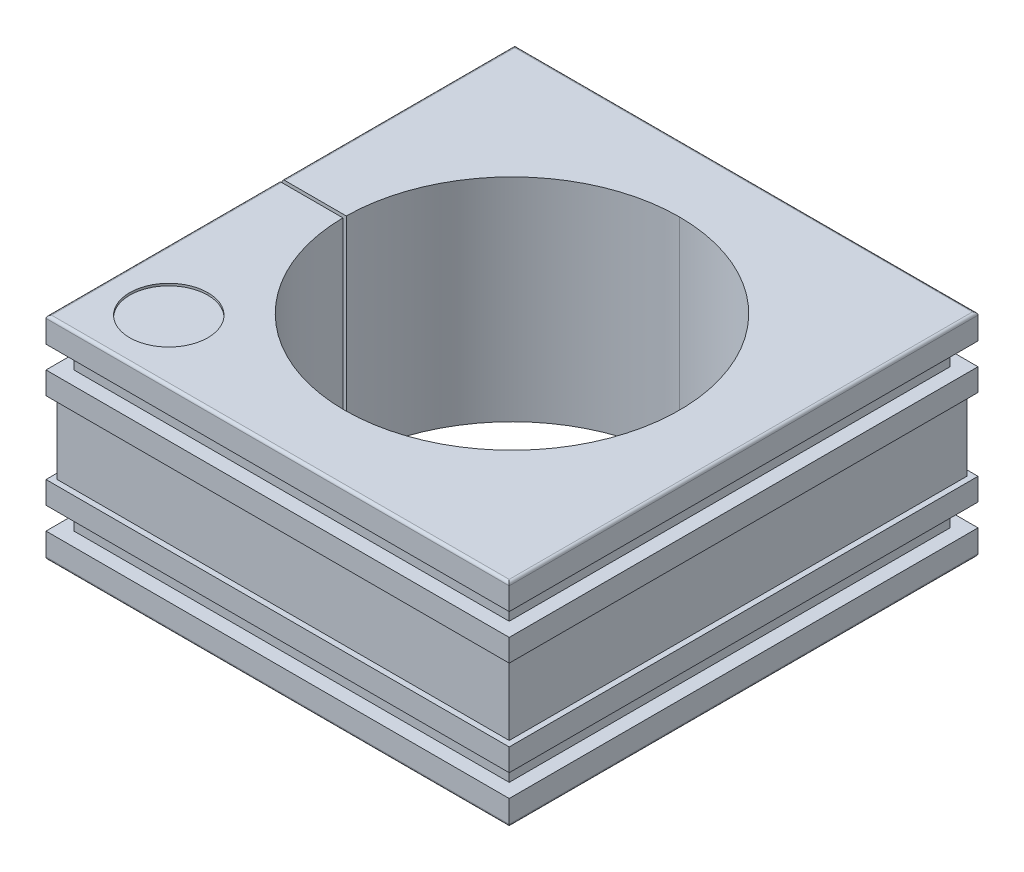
ISO-10303-21;
HEADER;
FILE_DESCRIPTION(('STEP AP214'),'2;1');
FILE_NAME('part.step','',(''),(''),'','','');
FILE_SCHEMA(('AUTOMOTIVE_DESIGN { 1 0 10303 214 1 1 1 1 }'));
ENDSEC;
DATA;
#1=APPLICATION_CONTEXT('core data for automotive mechanical design processes');
#2=APPLICATION_PROTOCOL_DEFINITION('international standard','automotive_design',2000,#1);
#3=PRODUCT_CONTEXT('',#1,'mechanical');
#4=PRODUCT('Part','Part','',(#3));
#5=PRODUCT_RELATED_PRODUCT_CATEGORY('part','',(#4));
#6=PRODUCT_DEFINITION_FORMATION('','',#4);
#7=PRODUCT_DEFINITION_CONTEXT('part definition',#1,'design');
#8=PRODUCT_DEFINITION('design','',#6,#7);
#9=PRODUCT_DEFINITION_SHAPE('','',#8);
#10=(LENGTH_UNIT() NAMED_UNIT(*) SI_UNIT(.MILLI.,.METRE.));
#11=(NAMED_UNIT(*) PLANE_ANGLE_UNIT() SI_UNIT($,.RADIAN.));
#12=(NAMED_UNIT(*) SI_UNIT($,.STERADIAN.) SOLID_ANGLE_UNIT());
#13=UNCERTAINTY_MEASURE_WITH_UNIT(LENGTH_MEASURE(1.E-05),#10,'distance_accuracy_value','');
#14=(GEOMETRIC_REPRESENTATION_CONTEXT(3) GLOBAL_UNCERTAINTY_ASSIGNED_CONTEXT((#13)) GLOBAL_UNIT_ASSIGNED_CONTEXT((#10,
#11,#12)) REPRESENTATION_CONTEXT('',''));
#15=CARTESIAN_POINT('',(0.,0.,0.));
#16=DIRECTION('',(0.,0.,1.));
#17=DIRECTION('',(1.,0.,0.));
#18=AXIS2_PLACEMENT_3D('',#15,#16,#17);
#19=CARTESIAN_POINT('',(-15.25,18.8,15.5));
#20=DIRECTION('',(0.,1.,0.));
#21=DIRECTION('',(1.,0.,0.));
#22=AXIS2_PLACEMENT_3D('',#19,#20,#21);
#23=PLANE('',#22);
#24=CARTESIAN_POINT('',(-15.25,18.8,15.5));
#25=DIRECTION('',(0.,1.,0.));
#26=DIRECTION('',(0.,0.,1.));
#27=AXIS2_PLACEMENT_3D('',#24,#25,#26);
#28=CIRCLE('',#27,3.5);
#29=CARTESIAN_POINT('',(-15.25,18.8,19.));
#30=VERTEX_POINT('',#29);
#31=CARTESIAN_POINT('',(-15.25,18.8,12.));
#32=VERTEX_POINT('',#31);
#33=EDGE_CURVE('E10',#30,#32,#28,.T.);
#34=ORIENTED_EDGE('',*,*,#33,.T.);
#35=CARTESIAN_POINT('',(-15.25,18.8,15.5));
#36=DIRECTION('',(0.,1.,0.));
#37=DIRECTION('',(0.,0.,1.));
#38=AXIS2_PLACEMENT_3D('',#35,#36,#37);
#39=CIRCLE('',#38,3.5);
#40=EDGE_CURVE('E1052',#32,#30,#39,.T.);
#41=ORIENTED_EDGE('',*,*,#40,.T.);
#42=EDGE_LOOP('',(#34,#41));
#43=FACE_BOUND('',#42,.T.);
#44=ADVANCED_FACE('F15',(#43),#23,.T.);
#45=CARTESIAN_POINT('',(-15.25,18.8,15.5));
#46=DIRECTION('',(0.,1.,0.));
#47=DIRECTION('',(0.,0.,1.));
#48=AXIS2_PLACEMENT_3D('',#45,#46,#47);
#49=CYLINDRICAL_SURFACE('',#48,3.5);
#50=DIRECTION('',(0.,1.,0.));
#51=VECTOR('',#50,1.);
#52=CARTESIAN_POINT('',(-15.25,18.8,12.));
#53=LINE('',#52,#51);
#54=CARTESIAN_POINT('',(-15.25,19.,12.));
#55=VERTEX_POINT('',#54);
#56=EDGE_CURVE('E1055',#32,#55,#53,.T.);
#57=ORIENTED_EDGE('',*,*,#56,.F.);
#58=ORIENTED_EDGE('',*,*,#33,.F.);
#59=DIRECTION('',(0.,1.,0.));
#60=VECTOR('',#59,1.);
#61=CARTESIAN_POINT('',(-15.25,18.8,19.));
#62=LINE('',#61,#60);
#63=CARTESIAN_POINT('',(-15.25,19.,19.));
#64=VERTEX_POINT('',#63);
#65=EDGE_CURVE('E1078',#30,#64,#62,.T.);
#66=ORIENTED_EDGE('',*,*,#65,.T.);
#67=CARTESIAN_POINT('',(-15.25,19.,15.5));
#68=DIRECTION('',(0.,1.,0.));
#69=DIRECTION('',(0.,0.,1.));
#70=AXIS2_PLACEMENT_3D('',#67,#68,#69);
#71=CIRCLE('',#70,3.5);
#72=EDGE_CURVE('E757',#64,#55,#71,.T.);
#73=ORIENTED_EDGE('',*,*,#72,.T.);
#74=EDGE_LOOP('',(#57,#58,#66,#73));
#75=FACE_BOUND('',#74,.T.);
#76=ADVANCED_FACE('F1301',(#75),#49,.F.);
#77=CARTESIAN_POINT('',(-20.5,18.75,-21.));
#78=DIRECTION('',(0.,0.,1.));
#79=DIRECTION('',(1.,0.,0.));
#80=AXIS2_PLACEMENT_3D('',#77,#78,#79);
#81=CYLINDRICAL_SURFACE('',#80,0.25);
#82=CARTESIAN_POINT('',(-20.5,18.75,0.15));
#83=DIRECTION('',(0.,0.,-1.));
#84=DIRECTION('',(-1.,0.,0.));
#85=AXIS2_PLACEMENT_3D('',#82,#83,#84);
#86=CIRCLE('',#85,0.25);
#87=CARTESIAN_POINT('',(-20.75,18.75,0.15));
#88=VERTEX_POINT('',#87);
#89=CARTESIAN_POINT('',(-20.5,19.,0.15));
#90=VERTEX_POINT('',#89);
#91=EDGE_CURVE('E766',#88,#90,#86,.T.);
#92=ORIENTED_EDGE('',*,*,#91,.F.);
#93=DIRECTION('',(0.,0.,-1.));
#94=VECTOR('',#93,1.);
#95=CARTESIAN_POINT('',(-20.75,18.75,21.));
#96=LINE('',#95,#94);
#97=CARTESIAN_POINT('',(-20.75,18.75,21.));
#98=VERTEX_POINT('',#97);
#99=EDGE_CURVE('E840',#98,#88,#96,.T.);
#100=ORIENTED_EDGE('',*,*,#99,.F.);
#101=CARTESIAN_POINT('',(-20.75,18.75,21.));
#102=CARTESIAN_POINT('',(-20.75,18.8964466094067,21.));
#103=CARTESIAN_POINT('',(-20.6464466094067,19.,20.8964466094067));
#104=CARTESIAN_POINT('',(-20.5,19.,20.75));
#105=(BOUNDED_CURVE() B_SPLINE_CURVE(3,(#101,#102,#103,#104),.UNSPECIFIED.,.F.,
.F.) B_SPLINE_CURVE_WITH_KNOTS((4,4),(3.1415926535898,4.71238898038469),
.UNSPECIFIED.) CURVE() GEOMETRIC_REPRESENTATION_ITEM() RATIONAL_B_SPLINE_CURVE((1.,
0.804737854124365,0.804737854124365,1.)) REPRESENTATION_ITEM(''));
#106=CARTESIAN_POINT('',(-20.5,19.,20.75));
#107=VERTEX_POINT('',#106);
#108=EDGE_CURVE('E23',#98,#107,#105,.T.);
#109=ORIENTED_EDGE('',*,*,#108,.T.);
#110=DIRECTION('',(0.,0.,1.));
#111=VECTOR('',#110,1.);
#112=CARTESIAN_POINT('',(-20.5,19.,-21.));
#113=LINE('',#112,#111);
#114=EDGE_CURVE('E731',#90,#107,#113,.T.);
#115=ORIENTED_EDGE('',*,*,#114,.F.);
#116=EDGE_LOOP('',(#92,#100,#109,#115));
#117=FACE_BOUND('',#116,.T.);
#118=ADVANCED_FACE('F838',(#117),#81,.T.);
#119=CARTESIAN_POINT('',(-20.75,18.75,20.75));
#120=DIRECTION('',(1.,0.,0.));
#121=DIRECTION('',(0.,0.,-1.));
#122=AXIS2_PLACEMENT_3D('',#119,#120,#121);
#123=CYLINDRICAL_SURFACE('',#122,0.25);
#124=CARTESIAN_POINT('',(20.75,18.75,21.));
#125=CARTESIAN_POINT('',(20.75,18.8964466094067,21.));
#126=CARTESIAN_POINT('',(20.6464466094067,19.,20.8964466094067));
#127=CARTESIAN_POINT('',(20.5,19.,20.75));
#128=(BOUNDED_CURVE() B_SPLINE_CURVE(3,(#124,#125,#126,#127),.UNSPECIFIED.,.F.,
.F.) B_SPLINE_CURVE_WITH_KNOTS((4,4),(0.,1.5707963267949),
.UNSPECIFIED.) CURVE() GEOMETRIC_REPRESENTATION_ITEM() RATIONAL_B_SPLINE_CURVE((1.,
0.804737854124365,0.804737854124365,1.)) REPRESENTATION_ITEM(''));
#129=CARTESIAN_POINT('',(20.75,18.75,21.));
#130=VERTEX_POINT('',#129);
#131=CARTESIAN_POINT('',(20.5,19.,20.75));
#132=VERTEX_POINT('',#131);
#133=EDGE_CURVE('E818',#130,#132,#128,.T.);
#134=ORIENTED_EDGE('',*,*,#133,.T.);
#135=DIRECTION('',(1.,0.,0.));
#136=VECTOR('',#135,1.);
#137=CARTESIAN_POINT('',(-20.75,19.,20.75));
#138=LINE('',#137,#136);
#139=EDGE_CURVE('E735',#107,#132,#138,.T.);
#140=ORIENTED_EDGE('',*,*,#139,.F.);
#141=ORIENTED_EDGE('',*,*,#108,.F.);
#142=DIRECTION('',(-1.,0.,0.));
#143=VECTOR('',#142,1.);
#144=CARTESIAN_POINT('',(-20.75,18.75,21.));
#145=LINE('',#144,#143);
#146=EDGE_CURVE('E712',#130,#98,#145,.T.);
#147=ORIENTED_EDGE('',*,*,#146,.F.);
#148=EDGE_LOOP('',(#134,#140,#141,#147));
#149=FACE_BOUND('',#148,.T.);
#150=ADVANCED_FACE('F844',(#149),#123,.T.);
#151=CARTESIAN_POINT('',(20.5,18.75,-21.));
#152=DIRECTION('',(0.,0.,-1.));
#153=DIRECTION('',(-1.,0.,0.));
#154=AXIS2_PLACEMENT_3D('',#151,#152,#153);
#155=CYLINDRICAL_SURFACE('',#154,0.25);
#156=CARTESIAN_POINT('',(20.75,18.75,-21.));
#157=CARTESIAN_POINT('',(20.75,18.8964466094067,-21.));
#158=CARTESIAN_POINT('',(20.6464466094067,19.,-20.8964466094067));
#159=CARTESIAN_POINT('',(20.5,19.,-20.75));
#160=(BOUNDED_CURVE() B_SPLINE_CURVE(3,(#156,#157,#158,#159),.UNSPECIFIED.,.F.,
.F.) B_SPLINE_CURVE_WITH_KNOTS((4,4),(0.,1.5707963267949),
.UNSPECIFIED.) CURVE() GEOMETRIC_REPRESENTATION_ITEM() RATIONAL_B_SPLINE_CURVE((1.,
0.804737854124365,0.804737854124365,1.)) REPRESENTATION_ITEM(''));
#161=CARTESIAN_POINT('',(20.75,18.75,-21.));
#162=VERTEX_POINT('',#161);
#163=CARTESIAN_POINT('',(20.5,19.,-20.75));
#164=VERTEX_POINT('',#163);
#165=EDGE_CURVE('E810',#162,#164,#160,.T.);
#166=ORIENTED_EDGE('',*,*,#165,.T.);
#167=DIRECTION('',(0.,0.,-1.));
#168=VECTOR('',#167,1.);
#169=CARTESIAN_POINT('',(20.5,19.,-21.));
#170=LINE('',#169,#168);
#171=EDGE_CURVE('E739',#132,#164,#170,.T.);
#172=ORIENTED_EDGE('',*,*,#171,.F.);
#173=ORIENTED_EDGE('',*,*,#133,.F.);
#174=DIRECTION('',(0.,0.,1.));
#175=VECTOR('',#174,1.);
#176=CARTESIAN_POINT('',(20.75,18.75,21.));
#177=LINE('',#176,#175);
#178=EDGE_CURVE('E719',#162,#130,#177,.T.);
#179=ORIENTED_EDGE('',*,*,#178,.F.);
#180=EDGE_LOOP('',(#166,#172,#173,#179));
#181=FACE_BOUND('',#180,.T.);
#182=ADVANCED_FACE('F1276',(#181),#155,.T.);
#183=CARTESIAN_POINT('',(-20.75,18.75,-20.75));
#184=DIRECTION('',(-1.,0.,0.));
#185=DIRECTION('',(0.,0.,1.));
#186=AXIS2_PLACEMENT_3D('',#183,#184,#185);
#187=CYLINDRICAL_SURFACE('',#186,0.25);
#188=CARTESIAN_POINT('',(-20.75,18.75,-21.));
#189=CARTESIAN_POINT('',(-20.75,18.8964466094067,-21.));
#190=CARTESIAN_POINT('',(-20.6464466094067,19.,-20.8964466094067));
#191=CARTESIAN_POINT('',(-20.5,19.,-20.75));
#192=(BOUNDED_CURVE() B_SPLINE_CURVE(3,(#188,#189,#190,#191),.UNSPECIFIED.,.F.,
.F.) B_SPLINE_CURVE_WITH_KNOTS((4,4),(0.,1.5707963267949),
.UNSPECIFIED.) CURVE() GEOMETRIC_REPRESENTATION_ITEM() RATIONAL_B_SPLINE_CURVE((1.,
0.804737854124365,0.804737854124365,1.)) REPRESENTATION_ITEM(''));
#193=CARTESIAN_POINT('',(-20.75,18.75,-21.));
#194=VERTEX_POINT('',#193);
#195=CARTESIAN_POINT('',(-20.5,19.,-20.75));
#196=VERTEX_POINT('',#195);
#197=EDGE_CURVE('E42',#194,#196,#192,.T.);
#198=ORIENTED_EDGE('',*,*,#197,.T.);
#199=DIRECTION('',(-1.,0.,0.));
#200=VECTOR('',#199,1.);
#201=CARTESIAN_POINT('',(-20.75,19.,-20.75));
#202=LINE('',#201,#200);
#203=EDGE_CURVE('E743',#164,#196,#202,.T.);
#204=ORIENTED_EDGE('',*,*,#203,.F.);
#205=ORIENTED_EDGE('',*,*,#165,.F.);
#206=DIRECTION('',(1.,0.,0.));
#207=VECTOR('',#206,1.);
#208=CARTESIAN_POINT('',(-20.75,18.75,-21.));
#209=LINE('',#208,#207);
#210=EDGE_CURVE('E723',#194,#162,#209,.T.);
#211=ORIENTED_EDGE('',*,*,#210,.F.);
#212=EDGE_LOOP('',(#198,#204,#205,#211));
#213=FACE_BOUND('',#212,.T.);
#214=ADVANCED_FACE('F1277',(#213),#187,.T.);
#215=CARTESIAN_POINT('',(-20.5,18.75,-21.));
#216=DIRECTION('',(0.,0.,1.));
#217=DIRECTION('',(1.,0.,0.));
#218=AXIS2_PLACEMENT_3D('',#215,#216,#217);
#219=CYLINDRICAL_SURFACE('',#218,0.25);
#220=CARTESIAN_POINT('',(-20.5,18.75,-0.15));
#221=DIRECTION('',(0.,0.,1.));
#222=DIRECTION('',(-1.,0.,0.));
#223=AXIS2_PLACEMENT_3D('',#220,#221,#222);
#224=CIRCLE('',#223,0.25);
#225=CARTESIAN_POINT('',(-20.5,19.,-0.15));
#226=VERTEX_POINT('',#225);
#227=CARTESIAN_POINT('',(-20.75,18.75,-0.15));
#228=VERTEX_POINT('',#227);
#229=EDGE_CURVE('E33',#226,#228,#224,.T.);
#230=ORIENTED_EDGE('',*,*,#229,.F.);
#231=DIRECTION('',(0.,0.,1.));
#232=VECTOR('',#231,1.);
#233=CARTESIAN_POINT('',(-20.5,19.,-21.));
#234=LINE('',#233,#232);
#235=EDGE_CURVE('E747',#196,#226,#234,.T.);
#236=ORIENTED_EDGE('',*,*,#235,.F.);
#237=ORIENTED_EDGE('',*,*,#197,.F.);
#238=DIRECTION('',(0.,0.,-1.));
#239=VECTOR('',#238,1.);
#240=CARTESIAN_POINT('',(-20.75,18.75,21.));
#241=LINE('',#240,#239);
#242=EDGE_CURVE('E702',#228,#194,#241,.T.);
#243=ORIENTED_EDGE('',*,*,#242,.F.);
#244=EDGE_LOOP('',(#230,#236,#237,#243));
#245=FACE_BOUND('',#244,.T.);
#246=ADVANCED_FACE('F1285',(#245),#219,.T.);
#247=CARTESIAN_POINT('',(-20.5,0.25,21.));
#248=DIRECTION('',(0.,0.,-1.));
#249=DIRECTION('',(-1.,0.,0.));
#250=AXIS2_PLACEMENT_3D('',#247,#248,#249);
#251=CYLINDRICAL_SURFACE('',#250,0.25);
#252=CARTESIAN_POINT('',(-20.75,0.25,-21.));
#253=CARTESIAN_POINT('',(-20.75,0.103553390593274,-21.));
#254=CARTESIAN_POINT('',(-20.6464466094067,0.,-20.8964466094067));
#255=CARTESIAN_POINT('',(-20.5,0.,-20.75));
#256=(BOUNDED_CURVE() B_SPLINE_CURVE(3,(#252,#253,#254,#255),.UNSPECIFIED.,.F.,
.F.) B_SPLINE_CURVE_WITH_KNOTS((4,4),(3.1415926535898,4.71238898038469),
.UNSPECIFIED.) CURVE() GEOMETRIC_REPRESENTATION_ITEM() RATIONAL_B_SPLINE_CURVE((1.,
0.804737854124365,0.804737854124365,1.)) REPRESENTATION_ITEM(''));
#257=CARTESIAN_POINT('',(-20.75,0.25,-21.));
#258=VERTEX_POINT('',#257);
#259=CARTESIAN_POINT('',(-20.5,0.,-20.75));
#260=VERTEX_POINT('',#259);
#261=EDGE_CURVE('E795',#258,#260,#256,.T.);
#262=ORIENTED_EDGE('',*,*,#261,.T.);
#263=DIRECTION('',(0.,0.,-1.));
#264=VECTOR('',#263,1.);
#265=CARTESIAN_POINT('',(-20.5,0.,-21.));
#266=LINE('',#265,#264);
#267=CARTESIAN_POINT('',(-20.5,0.,-0.15));
#268=VERTEX_POINT('',#267);
#269=EDGE_CURVE('E960',#268,#260,#266,.T.);
#270=ORIENTED_EDGE('',*,*,#269,.F.);
#271=CARTESIAN_POINT('',(-20.5,0.25,-0.15));
#272=DIRECTION('',(0.,0.,1.));
#273=DIRECTION('',(-1.,0.,0.));
#274=AXIS2_PLACEMENT_3D('',#271,#272,#273);
#275=CIRCLE('',#274,0.25);
#276=CARTESIAN_POINT('',(-20.75,0.25,-0.15));
#277=VERTEX_POINT('',#276);
#278=EDGE_CURVE('E769',#277,#268,#275,.T.);
#279=ORIENTED_EDGE('',*,*,#278,.F.);
#280=DIRECTION('',(0.,0.,1.));
#281=VECTOR('',#280,1.);
#282=CARTESIAN_POINT('',(-20.75,0.25,-0.15));
#283=LINE('',#282,#281);
#284=EDGE_CURVE('E480',#258,#277,#283,.T.);
#285=ORIENTED_EDGE('',*,*,#284,.F.);
#286=EDGE_LOOP('',(#262,#270,#279,#285));
#287=FACE_BOUND('',#286,.T.);
#288=ADVANCED_FACE('F1287',(#287),#251,.T.);
#289=CARTESIAN_POINT('',(-20.75,0.25,-20.75));
#290=DIRECTION('',(1.,0.,0.));
#291=DIRECTION('',(0.,0.,-1.));
#292=AXIS2_PLACEMENT_3D('',#289,#290,#291);
#293=CYLINDRICAL_SURFACE('',#292,0.25);
#294=CARTESIAN_POINT('',(20.75,0.25,-21.));
#295=CARTESIAN_POINT('',(20.75,0.103553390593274,-21.));
#296=CARTESIAN_POINT('',(20.6464466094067,0.,-20.8964466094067));
#297=CARTESIAN_POINT('',(20.5,0.,-20.75));
#298=(BOUNDED_CURVE() B_SPLINE_CURVE(3,(#294,#295,#296,#297),.UNSPECIFIED.,.F.,
.F.) B_SPLINE_CURVE_WITH_KNOTS((4,4),(0.,1.5707963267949),
.UNSPECIFIED.) CURVE() GEOMETRIC_REPRESENTATION_ITEM() RATIONAL_B_SPLINE_CURVE((1.,
0.804737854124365,0.804737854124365,1.)) REPRESENTATION_ITEM(''));
#299=CARTESIAN_POINT('',(20.75,0.25,-21.));
#300=VERTEX_POINT('',#299);
#301=CARTESIAN_POINT('',(20.5,0.,-20.75));
#302=VERTEX_POINT('',#301);
#303=EDGE_CURVE('E787',#300,#302,#298,.T.);
#304=ORIENTED_EDGE('',*,*,#303,.T.);
#305=DIRECTION('',(1.,0.,0.));
#306=VECTOR('',#305,1.);
#307=CARTESIAN_POINT('',(20.75,0.,-20.75));
#308=LINE('',#307,#306);
#309=EDGE_CURVE('E554',#260,#302,#308,.T.);
#310=ORIENTED_EDGE('',*,*,#309,.F.);
#311=ORIENTED_EDGE('',*,*,#261,.F.);
#312=DIRECTION('',(-1.,0.,0.));
#313=VECTOR('',#312,1.);
#314=CARTESIAN_POINT('',(-20.75,0.25,-21.));
#315=LINE('',#314,#313);
#316=EDGE_CURVE('E474',#300,#258,#315,.T.);
#317=ORIENTED_EDGE('',*,*,#316,.F.);
#318=EDGE_LOOP('',(#304,#310,#311,#317));
#319=FACE_BOUND('',#318,.T.);
#320=ADVANCED_FACE('F1294',(#319),#293,.T.);
#321=CARTESIAN_POINT('',(20.5,0.25,21.));
#322=DIRECTION('',(0.,0.,1.));
#323=DIRECTION('',(1.,0.,0.));
#324=AXIS2_PLACEMENT_3D('',#321,#322,#323);
#325=CYLINDRICAL_SURFACE('',#324,0.25);
#326=CARTESIAN_POINT('',(20.75,0.25,21.));
#327=CARTESIAN_POINT('',(20.75,0.103553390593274,21.));
#328=CARTESIAN_POINT('',(20.6464466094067,0.,20.8964466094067));
#329=CARTESIAN_POINT('',(20.5,0.,20.75));
#330=(BOUNDED_CURVE() B_SPLINE_CURVE(3,(#326,#327,#328,#329),.UNSPECIFIED.,.F.,
.F.) B_SPLINE_CURVE_WITH_KNOTS((4,4),(0.,1.5707963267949),
.UNSPECIFIED.) CURVE() GEOMETRIC_REPRESENTATION_ITEM() RATIONAL_B_SPLINE_CURVE((1.,
0.804737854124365,0.804737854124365,1.)) REPRESENTATION_ITEM(''));
#331=CARTESIAN_POINT('',(20.75,0.25,21.));
#332=VERTEX_POINT('',#331);
#333=CARTESIAN_POINT('',(20.5,0.,20.75));
#334=VERTEX_POINT('',#333);
#335=EDGE_CURVE('E779',#332,#334,#330,.T.);
#336=ORIENTED_EDGE('',*,*,#335,.T.);
#337=DIRECTION('',(0.,0.,1.));
#338=VECTOR('',#337,1.);
#339=CARTESIAN_POINT('',(20.5,0.,21.));
#340=LINE('',#339,#338);
#341=EDGE_CURVE('E549',#302,#334,#340,.T.);
#342=ORIENTED_EDGE('',*,*,#341,.F.);
#343=ORIENTED_EDGE('',*,*,#303,.F.);
#344=DIRECTION('',(0.,0.,-1.));
#345=VECTOR('',#344,1.);
#346=CARTESIAN_POINT('',(20.75,0.25,-21.));
#347=LINE('',#346,#345);
#348=EDGE_CURVE('E521',#332,#300,#347,.T.);
#349=ORIENTED_EDGE('',*,*,#348,.F.);
#350=EDGE_LOOP('',(#336,#342,#343,#349));
#351=FACE_BOUND('',#350,.T.);
#352=ADVANCED_FACE('F1369',(#351),#325,.T.);
#353=CARTESIAN_POINT('',(-20.75,0.25,20.75));
#354=DIRECTION('',(-1.,0.,0.));
#355=DIRECTION('',(0.,0.,1.));
#356=AXIS2_PLACEMENT_3D('',#353,#354,#355);
#357=CYLINDRICAL_SURFACE('',#356,0.25);
#358=CARTESIAN_POINT('',(-20.75,0.25,21.));
#359=CARTESIAN_POINT('',(-20.75,0.103553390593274,21.));
#360=CARTESIAN_POINT('',(-20.6464466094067,0.,20.8964466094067));
#361=CARTESIAN_POINT('',(-20.5,0.,20.75));
#362=(BOUNDED_CURVE() B_SPLINE_CURVE(3,(#358,#359,#360,#361),.UNSPECIFIED.,.F.,
.F.) B_SPLINE_CURVE_WITH_KNOTS((4,4),(0.,1.5707963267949),
.UNSPECIFIED.) CURVE() GEOMETRIC_REPRESENTATION_ITEM() RATIONAL_B_SPLINE_CURVE((1.,
0.804737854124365,0.804737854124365,1.)) REPRESENTATION_ITEM(''));
#363=CARTESIAN_POINT('',(-20.75,0.25,21.));
#364=VERTEX_POINT('',#363);
#365=CARTESIAN_POINT('',(-20.5,0.,20.75));
#366=VERTEX_POINT('',#365);
#367=EDGE_CURVE('E774',#364,#366,#362,.T.);
#368=ORIENTED_EDGE('',*,*,#367,.T.);
#369=DIRECTION('',(-1.,0.,0.));
#370=VECTOR('',#369,1.);
#371=CARTESIAN_POINT('',(-20.75,0.,20.75));
#372=LINE('',#371,#370);
#373=EDGE_CURVE('E553',#334,#366,#372,.T.);
#374=ORIENTED_EDGE('',*,*,#373,.F.);
#375=ORIENTED_EDGE('',*,*,#335,.F.);
#376=DIRECTION('',(1.,0.,0.));
#377=VECTOR('',#376,1.);
#378=CARTESIAN_POINT('',(20.75,0.25,21.));
#379=LINE('',#378,#377);
#380=EDGE_CURVE('E541',#364,#332,#379,.T.);
#381=ORIENTED_EDGE('',*,*,#380,.F.);
#382=EDGE_LOOP('',(#368,#374,#375,#381));
#383=FACE_BOUND('',#382,.T.);
#384=ADVANCED_FACE('F1333',(#383),#357,.T.);
#385=CARTESIAN_POINT('',(-20.5,0.25,21.));
#386=DIRECTION('',(0.,0.,-1.));
#387=DIRECTION('',(-1.,0.,0.));
#388=AXIS2_PLACEMENT_3D('',#385,#386,#387);
#389=CYLINDRICAL_SURFACE('',#388,0.25);
#390=CARTESIAN_POINT('',(-20.5,0.25,0.15));
#391=DIRECTION('',(0.,0.,-1.));
#392=DIRECTION('',(-1.,0.,0.));
#393=AXIS2_PLACEMENT_3D('',#390,#391,#392);
#394=CIRCLE('',#393,0.25);
#395=CARTESIAN_POINT('',(-20.5,0.,0.15));
#396=VERTEX_POINT('',#395);
#397=CARTESIAN_POINT('',(-20.75,0.25,0.15));
#398=VERTEX_POINT('',#397);
#399=EDGE_CURVE('E763',#396,#398,#394,.T.);
#400=ORIENTED_EDGE('',*,*,#399,.F.);
#401=DIRECTION('',(0.,0.,-1.));
#402=VECTOR('',#401,1.);
#403=CARTESIAN_POINT('',(-20.5,0.,0.15));
#404=LINE('',#403,#402);
#405=EDGE_CURVE('E915',#366,#396,#404,.T.);
#406=ORIENTED_EDGE('',*,*,#405,.F.);
#407=ORIENTED_EDGE('',*,*,#367,.F.);
#408=DIRECTION('',(0.,0.,1.));
#409=VECTOR('',#408,1.);
#410=CARTESIAN_POINT('',(-20.75,0.25,21.));
#411=LINE('',#410,#409);
#412=EDGE_CURVE('E1056',#398,#364,#411,.T.);
#413=ORIENTED_EDGE('',*,*,#412,.F.);
#414=EDGE_LOOP('',(#400,#406,#407,#413));
#415=FACE_BOUND('',#414,.T.);
#416=ADVANCED_FACE('F1331',(#415),#389,.T.);
#417=CARTESIAN_POINT('',(-20.75,19.,-0.15));
#418=DIRECTION('',(0.,0.,-1.));
#419=DIRECTION('',(0.,-1.,0.));
#420=AXIS2_PLACEMENT_3D('',#417,#418,#419);
#421=PLANE('',#420);
#422=DIRECTION('',(0.,-1.,0.));
#423=VECTOR('',#422,1.);
#424=CARTESIAN_POINT('',(-20.75,0.,-0.15));
#425=LINE('',#424,#423);
#426=CARTESIAN_POINT('',(-20.75,2.25,-0.15));
#427=VERTEX_POINT('',#426);
#428=EDGE_CURVE('E494',#427,#277,#425,.T.);
#429=ORIENTED_EDGE('',*,*,#428,.T.);
#430=ORIENTED_EDGE('',*,*,#278,.T.);
#431=DIRECTION('',(1.,0.,0.));
#432=VECTOR('',#431,1.);
#433=CARTESIAN_POINT('',(-20.75,0.,-0.15));
#434=LINE('',#433,#432);
#435=CARTESIAN_POINT('',(-14.9992499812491,0.,-0.15));
#436=VERTEX_POINT('',#435);
#437=EDGE_CURVE('E932',#268,#436,#434,.T.);
#438=ORIENTED_EDGE('',*,*,#437,.T.);
#439=DIRECTION('',(0.,-1.,0.));
#440=VECTOR('',#439,1.);
#441=CARTESIAN_POINT('',(-14.9992499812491,-42.4264068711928,-0.15));
#442=LINE('',#441,#440);
#443=CARTESIAN_POINT('',(-14.9992499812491,19.,-0.15));
#444=VERTEX_POINT('',#443);
#445=EDGE_CURVE('E1120',#444,#436,#442,.T.);
#446=ORIENTED_EDGE('',*,*,#445,.F.);
#447=DIRECTION('',(-1.,0.,0.));
#448=VECTOR('',#447,1.);
#449=CARTESIAN_POINT('',(-20.75,19.,-0.15));
#450=LINE('',#449,#448);
#451=EDGE_CURVE('E751',#444,#226,#450,.T.);
#452=ORIENTED_EDGE('',*,*,#451,.T.);
#453=ORIENTED_EDGE('',*,*,#229,.T.);
#454=DIRECTION('',(0.,-1.,0.));
#455=VECTOR('',#454,1.);
#456=CARTESIAN_POINT('',(-20.75,0.,-0.15));
#457=LINE('',#456,#455);
#458=CARTESIAN_POINT('',(-20.75,16.75,-0.15));
#459=VERTEX_POINT('',#458);
#460=EDGE_CURVE('E699',#228,#459,#457,.T.);
#461=ORIENTED_EDGE('',*,*,#460,.T.);
#462=DIRECTION('',(1.,0.,0.));
#463=VECTOR('',#462,1.);
#464=CARTESIAN_POINT('',(-20.75,16.75,-0.15));
#465=LINE('',#464,#463);
#466=CARTESIAN_POINT('',(-19.5,16.75,-0.15));
#467=VERTEX_POINT('',#466);
#468=EDGE_CURVE('E677',#459,#467,#465,.T.);
#469=ORIENTED_EDGE('',*,*,#468,.T.);
#470=DIRECTION('',(0.,1.,0.));
#471=VECTOR('',#470,1.);
#472=CARTESIAN_POINT('',(-19.5,16.75,-0.15));
#473=LINE('',#472,#471);
#474=CARTESIAN_POINT('',(-19.5,14.75,-0.15));
#475=VERTEX_POINT('',#474);
#476=EDGE_CURVE('E589',#475,#467,#473,.T.);
#477=ORIENTED_EDGE('',*,*,#476,.F.);
#478=DIRECTION('',(1.,0.,0.));
#479=VECTOR('',#478,1.);
#480=CARTESIAN_POINT('',(-20.75,14.75,-0.15));
#481=LINE('',#480,#479);
#482=CARTESIAN_POINT('',(-20.75,14.75,-0.15));
#483=VERTEX_POINT('',#482);
#484=EDGE_CURVE('E881',#483,#475,#481,.T.);
#485=ORIENTED_EDGE('',*,*,#484,.F.);
#486=DIRECTION('',(0.,-1.,0.));
#487=VECTOR('',#486,1.);
#488=CARTESIAN_POINT('',(-20.75,0.,-0.15));
#489=LINE('',#488,#487);
#490=CARTESIAN_POINT('',(-20.75,12.75,-0.15));
#491=VERTEX_POINT('',#490);
#492=EDGE_CURVE('E655',#483,#491,#489,.T.);
#493=ORIENTED_EDGE('',*,*,#492,.T.);
#494=DIRECTION('',(1.,0.,0.));
#495=VECTOR('',#494,1.);
#496=CARTESIAN_POINT('',(-20.75,12.75,-0.15));
#497=LINE('',#496,#495);
#498=CARTESIAN_POINT('',(-20.25,12.75,-0.15));
#499=VERTEX_POINT('',#498);
#500=EDGE_CURVE('E645',#491,#499,#497,.T.);
#501=ORIENTED_EDGE('',*,*,#500,.T.);
#502=DIRECTION('',(0.,1.,0.));
#503=VECTOR('',#502,1.);
#504=CARTESIAN_POINT('',(-20.25,12.75,-0.15));
#505=LINE('',#504,#503);
#506=CARTESIAN_POINT('',(-20.25,6.25,-0.15));
#507=VERTEX_POINT('',#506);
#508=EDGE_CURVE('E625',#507,#499,#505,.T.);
#509=ORIENTED_EDGE('',*,*,#508,.F.);
#510=DIRECTION('',(1.,0.,0.));
#511=VECTOR('',#510,1.);
#512=CARTESIAN_POINT('',(-20.75,6.25,-0.15));
#513=LINE('',#512,#511);
#514=CARTESIAN_POINT('',(-20.75,6.25,-0.15));
#515=VERTEX_POINT('',#514);
#516=EDGE_CURVE('E936',#515,#507,#513,.T.);
#517=ORIENTED_EDGE('',*,*,#516,.F.);
#518=DIRECTION('',(0.,-1.,0.));
#519=VECTOR('',#518,1.);
#520=CARTESIAN_POINT('',(-20.75,0.,-0.15));
#521=LINE('',#520,#519);
#522=CARTESIAN_POINT('',(-20.75,4.25,-0.15));
#523=VERTEX_POINT('',#522);
#524=EDGE_CURVE('E609',#515,#523,#521,.T.);
#525=ORIENTED_EDGE('',*,*,#524,.T.);
#526=DIRECTION('',(1.,0.,0.));
#527=VECTOR('',#526,1.);
#528=CARTESIAN_POINT('',(-20.75,4.25,-0.15));
#529=LINE('',#528,#527);
#530=CARTESIAN_POINT('',(-19.5,4.25,-0.15));
#531=VERTEX_POINT('',#530);
#532=EDGE_CURVE('E590',#523,#531,#529,.T.);
#533=ORIENTED_EDGE('',*,*,#532,.T.);
#534=DIRECTION('',(0.,1.,0.));
#535=VECTOR('',#534,1.);
#536=CARTESIAN_POINT('',(-19.5,4.25,-0.15));
#537=LINE('',#536,#535);
#538=CARTESIAN_POINT('',(-19.5,2.25,-0.15));
#539=VERTEX_POINT('',#538);
#540=EDGE_CURVE('E558',#539,#531,#537,.T.);
#541=ORIENTED_EDGE('',*,*,#540,.F.);
#542=DIRECTION('',(1.,0.,0.));
#543=VECTOR('',#542,1.);
#544=CARTESIAN_POINT('',(-20.75,2.25,-0.15));
#545=LINE('',#544,#543);
#546=EDGE_CURVE('E497',#427,#539,#545,.T.);
#547=ORIENTED_EDGE('',*,*,#546,.F.);
#548=EDGE_LOOP('',(#429,#430,#438,#446,#452,#453,#461,#469,#477,#485,#493,#501,#509,#517,#525,
#533,#541,#547));
#549=FACE_BOUND('',#548,.T.);
#550=ADVANCED_FACE('F1211',(#549),#421,.F.);
#551=CARTESIAN_POINT('',(-20.75,19.,0.15));
#552=DIRECTION('',(0.,0.,-1.));
#553=DIRECTION('',(0.,-1.,0.));
#554=AXIS2_PLACEMENT_3D('',#551,#552,#553);
#555=PLANE('',#554);
#556=DIRECTION('',(1.,0.,0.));
#557=VECTOR('',#556,1.);
#558=CARTESIAN_POINT('',(-20.75,0.,0.15));
#559=LINE('',#558,#557);
#560=CARTESIAN_POINT('',(-14.9992499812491,0.,0.15));
#561=VERTEX_POINT('',#560);
#562=EDGE_CURVE('E559',#396,#561,#559,.T.);
#563=ORIENTED_EDGE('',*,*,#562,.F.);
#564=ORIENTED_EDGE('',*,*,#399,.T.);
#565=DIRECTION('',(0.,-1.,0.));
#566=VECTOR('',#565,1.);
#567=CARTESIAN_POINT('',(-20.75,0.,0.15));
#568=LINE('',#567,#566);
#569=CARTESIAN_POINT('',(-20.75,2.25,0.15));
#570=VERTEX_POINT('',#569);
#571=EDGE_CURVE('E1061',#570,#398,#568,.T.);
#572=ORIENTED_EDGE('',*,*,#571,.F.);
#573=DIRECTION('',(1.,0.,0.));
#574=VECTOR('',#573,1.);
#575=CARTESIAN_POINT('',(-20.75,2.25,0.15));
#576=LINE('',#575,#574);
#577=CARTESIAN_POINT('',(-19.5,2.25,0.15));
#578=VERTEX_POINT('',#577);
#579=EDGE_CURVE('E532',#570,#578,#576,.T.);
#580=ORIENTED_EDGE('',*,*,#579,.T.);
#581=DIRECTION('',(0.,1.,0.));
#582=VECTOR('',#581,1.);
#583=CARTESIAN_POINT('',(-19.5,4.25,0.15));
#584=LINE('',#583,#582);
#585=CARTESIAN_POINT('',(-19.5,4.25,0.15));
#586=VERTEX_POINT('',#585);
#587=EDGE_CURVE('E1086',#578,#586,#584,.T.);
#588=ORIENTED_EDGE('',*,*,#587,.T.);
#589=DIRECTION('',(1.,0.,0.));
#590=VECTOR('',#589,1.);
#591=CARTESIAN_POINT('',(-20.75,4.25,0.15));
#592=LINE('',#591,#590);
#593=CARTESIAN_POINT('',(-20.75,4.25,0.15));
#594=VERTEX_POINT('',#593);
#595=EDGE_CURVE('E605',#594,#586,#592,.T.);
#596=ORIENTED_EDGE('',*,*,#595,.F.);
#597=DIRECTION('',(0.,-1.,0.));
#598=VECTOR('',#597,1.);
#599=CARTESIAN_POINT('',(-20.75,0.,0.15));
#600=LINE('',#599,#598);
#601=CARTESIAN_POINT('',(-20.75,6.25,0.15));
#602=VERTEX_POINT('',#601);
#603=EDGE_CURVE('E1155',#602,#594,#600,.T.);
#604=ORIENTED_EDGE('',*,*,#603,.F.);
#605=DIRECTION('',(1.,0.,0.));
#606=VECTOR('',#605,1.);
#607=CARTESIAN_POINT('',(-20.75,6.25,0.15));
#608=LINE('',#607,#606);
#609=CARTESIAN_POINT('',(-20.25,6.25,0.15));
#610=VERTEX_POINT('',#609);
#611=EDGE_CURVE('E953',#602,#610,#608,.T.);
#612=ORIENTED_EDGE('',*,*,#611,.T.);
#613=DIRECTION('',(0.,1.,0.));
#614=VECTOR('',#613,1.);
#615=CARTESIAN_POINT('',(-20.25,12.75,0.15));
#616=LINE('',#615,#614);
#617=CARTESIAN_POINT('',(-20.25,12.75,0.15));
#618=VERTEX_POINT('',#617);
#619=EDGE_CURVE('E1010',#610,#618,#616,.T.);
#620=ORIENTED_EDGE('',*,*,#619,.T.);
#621=DIRECTION('',(1.,0.,0.));
#622=VECTOR('',#621,1.);
#623=CARTESIAN_POINT('',(-20.75,12.75,0.15));
#624=LINE('',#623,#622);
#625=CARTESIAN_POINT('',(-20.75,12.75,0.15));
#626=VERTEX_POINT('',#625);
#627=EDGE_CURVE('E573',#626,#618,#624,.T.);
#628=ORIENTED_EDGE('',*,*,#627,.F.);
#629=DIRECTION('',(0.,-1.,0.));
#630=VECTOR('',#629,1.);
#631=CARTESIAN_POINT('',(-20.75,0.,0.15));
#632=LINE('',#631,#630);
#633=CARTESIAN_POINT('',(-20.75,14.75,0.15));
#634=VERTEX_POINT('',#633);
#635=EDGE_CURVE('E1014',#634,#626,#632,.T.);
#636=ORIENTED_EDGE('',*,*,#635,.F.);
#637=DIRECTION('',(1.,0.,0.));
#638=VECTOR('',#637,1.);
#639=CARTESIAN_POINT('',(-20.75,14.75,0.15));
#640=LINE('',#639,#638);
#641=CARTESIAN_POINT('',(-19.5,14.75,0.15));
#642=VERTEX_POINT('',#641);
#643=EDGE_CURVE('E904',#634,#642,#640,.T.);
#644=ORIENTED_EDGE('',*,*,#643,.T.);
#645=DIRECTION('',(0.,1.,0.));
#646=VECTOR('',#645,1.);
#647=CARTESIAN_POINT('',(-19.5,16.75,0.15));
#648=LINE('',#647,#646);
#649=CARTESIAN_POINT('',(-19.5,16.75,0.15));
#650=VERTEX_POINT('',#649);
#651=EDGE_CURVE('E986',#642,#650,#648,.T.);
#652=ORIENTED_EDGE('',*,*,#651,.T.);
#653=DIRECTION('',(1.,0.,0.));
#654=VECTOR('',#653,1.);
#655=CARTESIAN_POINT('',(-20.75,16.75,0.15));
#656=LINE('',#655,#654);
#657=CARTESIAN_POINT('',(-20.75,16.75,0.15));
#658=VERTEX_POINT('',#657);
#659=EDGE_CURVE('E696',#658,#650,#656,.T.);
#660=ORIENTED_EDGE('',*,*,#659,.F.);
#661=DIRECTION('',(0.,-1.,0.));
#662=VECTOR('',#661,1.);
#663=CARTESIAN_POINT('',(-20.75,0.,0.15));
#664=LINE('',#663,#662);
#665=EDGE_CURVE('E857',#88,#658,#664,.T.);
#666=ORIENTED_EDGE('',*,*,#665,.F.);
#667=ORIENTED_EDGE('',*,*,#91,.T.);
#668=DIRECTION('',(-1.,0.,0.));
#669=VECTOR('',#668,1.);
#670=CARTESIAN_POINT('',(-20.75,19.,0.15));
#671=LINE('',#670,#669);
#672=CARTESIAN_POINT('',(-14.9992499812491,19.,0.15));
#673=VERTEX_POINT('',#672);
#674=EDGE_CURVE('E727',#673,#90,#671,.T.);
#675=ORIENTED_EDGE('',*,*,#674,.F.);
#676=DIRECTION('',(0.,-1.,0.));
#677=VECTOR('',#676,1.);
#678=CARTESIAN_POINT('',(-14.9992499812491,-42.4264068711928,0.15));
#679=LINE('',#678,#677);
#680=EDGE_CURVE('E760',#673,#561,#679,.T.);
#681=ORIENTED_EDGE('',*,*,#680,.T.);
#682=EDGE_LOOP('',(#563,#564,#572,#580,#588,#596,#604,#612,#620,#628,#636,#644,#652,#660,#666,
#667,#675,#681));
#683=FACE_BOUND('',#682,.T.);
#684=ADVANCED_FACE('F853',(#683),#555,.T.);
#685=CARTESIAN_POINT('',(0.,-42.4264068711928,0.));
#686=DIRECTION('',(0.,1.,0.));
#687=DIRECTION('',(0.,0.,1.));
#688=AXIS2_PLACEMENT_3D('',#685,#686,#687);
#689=CYLINDRICAL_SURFACE('',#688,15.);
#690=DIRECTION('',(0.,1.,0.));
#691=VECTOR('',#690,1.);
#692=CARTESIAN_POINT('',(0.,-42.4264068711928,15.));
#693=LINE('',#692,#691);
#694=CARTESIAN_POINT('',(0.,0.,15.));
#695=VERTEX_POINT('',#694);
#696=CARTESIAN_POINT('',(0.,19.,15.));
#697=VERTEX_POINT('',#696);
#698=EDGE_CURVE('E1121',#695,#697,#693,.T.);
#699=ORIENTED_EDGE('',*,*,#698,.F.);
#700=CARTESIAN_POINT('',(0.,0.,0.));
#701=DIRECTION('',(0.,1.,0.));
#702=DIRECTION('',(0.,0.,-1.));
#703=AXIS2_PLACEMENT_3D('',#700,#701,#702);
#704=CIRCLE('',#703,15.);
#705=EDGE_CURVE('E555',#561,#695,#704,.T.);
#706=ORIENTED_EDGE('',*,*,#705,.F.);
#707=ORIENTED_EDGE('',*,*,#680,.F.);
#708=CARTESIAN_POINT('',(0.,19.,0.));
#709=DIRECTION('',(0.,1.,0.));
#710=DIRECTION('',(0.,0.,1.));
#711=AXIS2_PLACEMENT_3D('',#708,#709,#710);
#712=CIRCLE('',#711,15.);
#713=EDGE_CURVE('E754',#673,#697,#712,.T.);
#714=ORIENTED_EDGE('',*,*,#713,.T.);
#715=EDGE_LOOP('',(#699,#706,#707,#714));
#716=FACE_BOUND('',#715,.T.);
#717=ADVANCED_FACE('F1316',(#716),#689,.F.);
#718=CARTESIAN_POINT('',(-20.75,19.,-21.));
#719=DIRECTION('',(0.,-1.,0.));
#720=DIRECTION('',(0.,0.,-1.));
#721=AXIS2_PLACEMENT_3D('',#718,#719,#720);
#722=PLANE('',#721);
#723=ORIENTED_EDGE('',*,*,#72,.F.);
#724=CARTESIAN_POINT('',(-15.25,19.,15.5));
#725=DIRECTION('',(0.,1.,0.));
#726=DIRECTION('',(0.,0.,1.));
#727=AXIS2_PLACEMENT_3D('',#724,#725,#726);
#728=CIRCLE('',#727,3.5);
#729=EDGE_CURVE('E1068',#55,#64,#728,.T.);
#730=ORIENTED_EDGE('',*,*,#729,.F.);
#731=EDGE_LOOP('',(#723,#730));
#732=FACE_BOUND('',#731,.T.);
#733=ORIENTED_EDGE('',*,*,#674,.T.);
#734=ORIENTED_EDGE('',*,*,#114,.T.);
#735=ORIENTED_EDGE('',*,*,#139,.T.);
#736=ORIENTED_EDGE('',*,*,#171,.T.);
#737=ORIENTED_EDGE('',*,*,#203,.T.);
#738=ORIENTED_EDGE('',*,*,#235,.T.);
#739=ORIENTED_EDGE('',*,*,#451,.F.);
#740=CARTESIAN_POINT('',(0.,19.,0.));
#741=DIRECTION('',(0.,1.,0.));
#742=DIRECTION('',(0.,0.,1.));
#743=AXIS2_PLACEMENT_3D('',#740,#741,#742);
#744=CIRCLE('',#743,15.);
#745=CARTESIAN_POINT('',(0.,19.,-15.));
#746=VERTEX_POINT('',#745);
#747=EDGE_CURVE('E1110',#746,#444,#744,.T.);
#748=ORIENTED_EDGE('',*,*,#747,.F.);
#749=CARTESIAN_POINT('',(0.,19.,0.));
#750=DIRECTION('',(0.,1.,0.));
#751=DIRECTION('',(0.,0.,1.));
#752=AXIS2_PLACEMENT_3D('',#749,#750,#751);
#753=CIRCLE('',#752,15.);
#754=EDGE_CURVE('E1093',#697,#746,#753,.T.);
#755=ORIENTED_EDGE('',*,*,#754,.F.);
#756=ORIENTED_EDGE('',*,*,#713,.F.);
#757=EDGE_LOOP('',(#733,#734,#735,#736,#737,#738,#739,#748,#755,#756));
#758=FACE_BOUND('',#757,.T.);
#759=ADVANCED_FACE('F847',(#732,#758),#722,.F.);
#760=CARTESIAN_POINT('',(-20.75,19.,-21.));
#761=DIRECTION('',(0.,0.,1.));
#762=DIRECTION('',(1.,0.,0.));
#763=AXIS2_PLACEMENT_3D('',#760,#761,#762);
#764=PLANE('',#763);
#765=DIRECTION('',(0.,-1.,0.));
#766=VECTOR('',#765,1.);
#767=CARTESIAN_POINT('',(-20.75,19.,-21.));
#768=LINE('',#767,#766);
#769=CARTESIAN_POINT('',(-20.75,16.75,-21.));
#770=VERTEX_POINT('',#769);
#771=EDGE_CURVE('E706',#194,#770,#768,.T.);
#772=ORIENTED_EDGE('',*,*,#771,.F.);
#773=ORIENTED_EDGE('',*,*,#210,.T.);
#774=DIRECTION('',(0.,-1.,0.));
#775=VECTOR('',#774,1.);
#776=CARTESIAN_POINT('',(20.75,19.,-21.));
#777=LINE('',#776,#775);
#778=CARTESIAN_POINT('',(20.75,16.75,-21.));
#779=VERTEX_POINT('',#778);
#780=EDGE_CURVE('E716',#162,#779,#777,.T.);
#781=ORIENTED_EDGE('',*,*,#780,.T.);
#782=DIRECTION('',(-1.,0.,0.));
#783=VECTOR('',#782,1.);
#784=CARTESIAN_POINT('',(-20.75,16.75,-21.));
#785=LINE('',#784,#783);
#786=EDGE_CURVE('E684',#779,#770,#785,.T.);
#787=ORIENTED_EDGE('',*,*,#786,.T.);
#788=EDGE_LOOP('',(#772,#773,#781,#787));
#789=FACE_BOUND('',#788,.T.);
#790=ADVANCED_FACE('F1280',(#789),#764,.F.);
#791=CARTESIAN_POINT('',(20.75,19.,21.));
#792=DIRECTION('',(-1.,0.,0.));
#793=DIRECTION('',(0.,0.,1.));
#794=AXIS2_PLACEMENT_3D('',#791,#792,#793);
#795=PLANE('',#794);
#796=ORIENTED_EDGE('',*,*,#780,.F.);
#797=ORIENTED_EDGE('',*,*,#178,.T.);
#798=DIRECTION('',(0.,-1.,0.));
#799=VECTOR('',#798,1.);
#800=CARTESIAN_POINT('',(20.75,19.,21.));
#801=LINE('',#800,#799);
#802=CARTESIAN_POINT('',(20.75,16.75,21.));
#803=VERTEX_POINT('',#802);
#804=EDGE_CURVE('E709',#130,#803,#801,.T.);
#805=ORIENTED_EDGE('',*,*,#804,.T.);
#806=DIRECTION('',(0.,0.,-1.));
#807=VECTOR('',#806,1.);
#808=CARTESIAN_POINT('',(20.75,16.75,21.));
#809=LINE('',#808,#807);
#810=EDGE_CURVE('E688',#803,#779,#809,.T.);
#811=ORIENTED_EDGE('',*,*,#810,.T.);
#812=EDGE_LOOP('',(#796,#797,#805,#811));
#813=FACE_BOUND('',#812,.T.);
#814=ADVANCED_FACE('F1272',(#813),#795,.F.);
#815=CARTESIAN_POINT('',(-20.75,19.,21.));
#816=DIRECTION('',(0.,0.,-1.));
#817=DIRECTION('',(0.,-1.,0.));
#818=AXIS2_PLACEMENT_3D('',#815,#816,#817);
#819=PLANE('',#818);
#820=ORIENTED_EDGE('',*,*,#804,.F.);
#821=ORIENTED_EDGE('',*,*,#146,.T.);
#822=DIRECTION('',(0.,-1.,0.));
#823=VECTOR('',#822,1.);
#824=CARTESIAN_POINT('',(-20.75,19.,21.));
#825=LINE('',#824,#823);
#826=CARTESIAN_POINT('',(-20.75,16.75,21.));
#827=VERTEX_POINT('',#826);
#828=EDGE_CURVE('E867',#98,#827,#825,.T.);
#829=ORIENTED_EDGE('',*,*,#828,.T.);
#830=DIRECTION('',(1.,0.,0.));
#831=VECTOR('',#830,1.);
#832=CARTESIAN_POINT('',(-20.75,16.75,21.));
#833=LINE('',#832,#831);
#834=EDGE_CURVE('E692',#827,#803,#833,.T.);
#835=ORIENTED_EDGE('',*,*,#834,.T.);
#836=EDGE_LOOP('',(#820,#821,#829,#835));
#837=FACE_BOUND('',#836,.T.);
#838=ADVANCED_FACE('F1269',(#837),#819,.F.);
#839=CARTESIAN_POINT('',(-20.75,19.,21.));
#840=DIRECTION('',(1.,0.,0.));
#841=DIRECTION('',(0.,1.,0.));
#842=AXIS2_PLACEMENT_3D('',#839,#840,#841);
#843=PLANE('',#842);
#844=ORIENTED_EDGE('',*,*,#460,.F.);
#845=ORIENTED_EDGE('',*,*,#242,.T.);
#846=ORIENTED_EDGE('',*,*,#771,.T.);
#847=DIRECTION('',(0.,0.,1.));
#848=VECTOR('',#847,1.);
#849=CARTESIAN_POINT('',(-20.75,16.75,21.));
#850=LINE('',#849,#848);
#851=EDGE_CURVE('E680',#770,#459,#850,.T.);
#852=ORIENTED_EDGE('',*,*,#851,.T.);
#853=EDGE_LOOP('',(#844,#845,#846,#852));
#854=FACE_BOUND('',#853,.T.);
#855=ADVANCED_FACE('F1284',(#854),#843,.F.);
#856=CARTESIAN_POINT('',(-20.75,16.75,-21.));
#857=DIRECTION('',(0.,-1.,0.));
#858=DIRECTION('',(0.,0.,-1.));
#859=AXIS2_PLACEMENT_3D('',#856,#857,#858);
#860=PLANE('',#859);
#861=ORIENTED_EDGE('',*,*,#468,.F.);
#862=ORIENTED_EDGE('',*,*,#851,.F.);
#863=ORIENTED_EDGE('',*,*,#786,.F.);
#864=ORIENTED_EDGE('',*,*,#810,.F.);
#865=ORIENTED_EDGE('',*,*,#834,.F.);
#866=DIRECTION('',(0.,0.,1.));
#867=VECTOR('',#866,1.);
#868=CARTESIAN_POINT('',(-20.75,16.75,21.));
#869=LINE('',#868,#867);
#870=EDGE_CURVE('E863',#658,#827,#869,.T.);
#871=ORIENTED_EDGE('',*,*,#870,.F.);
#872=ORIENTED_EDGE('',*,*,#659,.T.);
#873=DIRECTION('',(0.,0.,1.));
#874=VECTOR('',#873,1.);
#875=CARTESIAN_POINT('',(-19.5,16.75,19.75));
#876=LINE('',#875,#874);
#877=CARTESIAN_POINT('',(-19.5,16.75,19.75));
#878=VERTEX_POINT('',#877);
#879=EDGE_CURVE('E871',#650,#878,#876,.T.);
#880=ORIENTED_EDGE('',*,*,#879,.T.);
#881=DIRECTION('',(1.,0.,0.));
#882=VECTOR('',#881,1.);
#883=CARTESIAN_POINT('',(-19.5,16.75,19.75));
#884=LINE('',#883,#882);
#885=CARTESIAN_POINT('',(19.5,16.75,19.75));
#886=VERTEX_POINT('',#885);
#887=EDGE_CURVE('E672',#878,#886,#884,.T.);
#888=ORIENTED_EDGE('',*,*,#887,.T.);
#889=DIRECTION('',(0.,0.,-1.));
#890=VECTOR('',#889,1.);
#891=CARTESIAN_POINT('',(19.5,16.75,19.75));
#892=LINE('',#891,#890);
#893=CARTESIAN_POINT('',(19.5,16.75,-19.75));
#894=VERTEX_POINT('',#893);
#895=EDGE_CURVE('E617',#886,#894,#892,.T.);
#896=ORIENTED_EDGE('',*,*,#895,.T.);
#897=DIRECTION('',(-1.,0.,0.));
#898=VECTOR('',#897,1.);
#899=CARTESIAN_POINT('',(-19.5,16.75,-19.75));
#900=LINE('',#899,#898);
#901=CARTESIAN_POINT('',(-19.5,16.75,-19.75));
#902=VERTEX_POINT('',#901);
#903=EDGE_CURVE('E621',#894,#902,#900,.T.);
#904=ORIENTED_EDGE('',*,*,#903,.T.);
#905=DIRECTION('',(0.,0.,1.));
#906=VECTOR('',#905,1.);
#907=CARTESIAN_POINT('',(-19.5,16.75,19.75));
#908=LINE('',#907,#906);
#909=EDGE_CURVE('E584',#902,#467,#908,.T.);
#910=ORIENTED_EDGE('',*,*,#909,.T.);
#911=EDGE_LOOP('',(#861,#862,#863,#864,#865,#871,#872,#880,#888,#896,#904,#910));
#912=FACE_BOUND('',#911,.T.);
#913=ADVANCED_FACE('F1265',(#912),#860,.T.);
#914=CARTESIAN_POINT('',(-19.5,16.75,-19.75));
#915=DIRECTION('',(0.,0.,1.));
#916=DIRECTION('',(1.,0.,0.));
#917=AXIS2_PLACEMENT_3D('',#914,#915,#916);
#918=PLANE('',#917);
#919=DIRECTION('',(-1.,0.,0.));
#920=VECTOR('',#919,1.);
#921=CARTESIAN_POINT('',(-19.5,14.75,-19.75));
#922=LINE('',#921,#920);
#923=CARTESIAN_POINT('',(19.5,14.75,-19.75));
#924=VERTEX_POINT('',#923);
#925=CARTESIAN_POINT('',(-19.5,14.75,-19.75));
#926=VERTEX_POINT('',#925);
#927=EDGE_CURVE('E892',#924,#926,#922,.T.);
#928=ORIENTED_EDGE('',*,*,#927,.T.);
#929=DIRECTION('',(0.,-1.,0.));
#930=VECTOR('',#929,1.);
#931=CARTESIAN_POINT('',(-19.5,16.75,-19.75));
#932=LINE('',#931,#930);
#933=EDGE_CURVE('E588',#902,#926,#932,.T.);
#934=ORIENTED_EDGE('',*,*,#933,.F.);
#935=ORIENTED_EDGE('',*,*,#903,.F.);
#936=DIRECTION('',(0.,-1.,0.));
#937=VECTOR('',#936,1.);
#938=CARTESIAN_POINT('',(19.5,16.75,-19.75));
#939=LINE('',#938,#937);
#940=EDGE_CURVE('E622',#894,#924,#939,.T.);
#941=ORIENTED_EDGE('',*,*,#940,.T.);
#942=EDGE_LOOP('',(#928,#934,#935,#941));
#943=FACE_BOUND('',#942,.T.);
#944=ADVANCED_FACE('F1252',(#943),#918,.F.);
#945=CARTESIAN_POINT('',(19.5,16.75,19.75));
#946=DIRECTION('',(-1.,0.,0.));
#947=DIRECTION('',(0.,0.,1.));
#948=AXIS2_PLACEMENT_3D('',#945,#946,#947);
#949=PLANE('',#948);
#950=DIRECTION('',(0.,0.,-1.));
#951=VECTOR('',#950,1.);
#952=CARTESIAN_POINT('',(19.5,14.75,19.75));
#953=LINE('',#952,#951);
#954=CARTESIAN_POINT('',(19.5,14.75,19.75));
#955=VERTEX_POINT('',#954);
#956=EDGE_CURVE('E896',#955,#924,#953,.T.);
#957=ORIENTED_EDGE('',*,*,#956,.T.);
#958=ORIENTED_EDGE('',*,*,#940,.F.);
#959=ORIENTED_EDGE('',*,*,#895,.F.);
#960=DIRECTION('',(0.,-1.,0.));
#961=VECTOR('',#960,1.);
#962=CARTESIAN_POINT('',(19.5,16.75,19.75));
#963=LINE('',#962,#961);
#964=EDGE_CURVE('E596',#886,#955,#963,.T.);
#965=ORIENTED_EDGE('',*,*,#964,.T.);
#966=EDGE_LOOP('',(#957,#958,#959,#965));
#967=FACE_BOUND('',#966,.T.);
#968=ADVANCED_FACE('F1255',(#967),#949,.F.);
#969=CARTESIAN_POINT('',(-19.5,16.75,19.75));
#970=DIRECTION('',(0.,0.,-1.));
#971=DIRECTION('',(0.,-1.,0.));
#972=AXIS2_PLACEMENT_3D('',#969,#970,#971);
#973=PLANE('',#972);
#974=DIRECTION('',(1.,0.,0.));
#975=VECTOR('',#974,1.);
#976=CARTESIAN_POINT('',(-19.5,14.75,19.75));
#977=LINE('',#976,#975);
#978=CARTESIAN_POINT('',(-19.5,14.75,19.75));
#979=VERTEX_POINT('',#978);
#980=EDGE_CURVE('E900',#979,#955,#977,.T.);
#981=ORIENTED_EDGE('',*,*,#980,.T.);
#982=ORIENTED_EDGE('',*,*,#964,.F.);
#983=ORIENTED_EDGE('',*,*,#887,.F.);
#984=DIRECTION('',(0.,-1.,0.));
#985=VECTOR('',#984,1.);
#986=CARTESIAN_POINT('',(-19.5,16.75,19.75));
#987=LINE('',#986,#985);
#988=EDGE_CURVE('E1106',#878,#979,#987,.T.);
#989=ORIENTED_EDGE('',*,*,#988,.T.);
#990=EDGE_LOOP('',(#981,#982,#983,#989));
#991=FACE_BOUND('',#990,.T.);
#992=ADVANCED_FACE('F1259',(#991),#973,.F.);
#993=CARTESIAN_POINT('',(-19.5,16.75,19.75));
#994=DIRECTION('',(1.,0.,0.));
#995=DIRECTION('',(0.,1.,0.));
#996=AXIS2_PLACEMENT_3D('',#993,#994,#995);
#997=PLANE('',#996);
#998=DIRECTION('',(0.,0.,1.));
#999=VECTOR('',#998,1.);
#1000=CARTESIAN_POINT('',(-19.5,14.75,19.75));
#1001=LINE('',#1000,#999);
#1002=EDGE_CURVE('E885',#926,#475,#1001,.T.);
#1003=ORIENTED_EDGE('',*,*,#1002,.T.);
#1004=ORIENTED_EDGE('',*,*,#476,.T.);
#1005=ORIENTED_EDGE('',*,*,#909,.F.);
#1006=ORIENTED_EDGE('',*,*,#933,.T.);
#1007=EDGE_LOOP('',(#1003,#1004,#1005,#1006));
#1008=FACE_BOUND('',#1007,.T.);
#1009=ADVANCED_FACE('F1248',(#1008),#997,.F.);
#1010=CARTESIAN_POINT('',(-20.75,14.75,-21.));
#1011=DIRECTION('',(0.,0.,1.));
#1012=DIRECTION('',(1.,0.,0.));
#1013=AXIS2_PLACEMENT_3D('',#1010,#1011,#1012);
#1014=PLANE('',#1013);
#1015=DIRECTION('',(-1.,0.,0.));
#1016=VECTOR('',#1015,1.);
#1017=CARTESIAN_POINT('',(-20.75,12.75,-21.));
#1018=LINE('',#1017,#1016);
#1019=CARTESIAN_POINT('',(20.75,12.75,-21.));
#1020=VERTEX_POINT('',#1019);
#1021=CARTESIAN_POINT('',(-20.75,12.75,-21.));
#1022=VERTEX_POINT('',#1021);
#1023=EDGE_CURVE('E565',#1020,#1022,#1018,.T.);
#1024=ORIENTED_EDGE('',*,*,#1023,.T.);
#1025=DIRECTION('',(0.,-1.,0.));
#1026=VECTOR('',#1025,1.);
#1027=CARTESIAN_POINT('',(-20.75,14.75,-21.));
#1028=LINE('',#1027,#1026);
#1029=CARTESIAN_POINT('',(-20.75,14.75,-21.));
#1030=VERTEX_POINT('',#1029);
#1031=EDGE_CURVE('E658',#1030,#1022,#1028,.T.);
#1032=ORIENTED_EDGE('',*,*,#1031,.F.);
#1033=DIRECTION('',(-1.,0.,0.));
#1034=VECTOR('',#1033,1.);
#1035=CARTESIAN_POINT('',(-20.75,14.75,-21.));
#1036=LINE('',#1035,#1034);
#1037=CARTESIAN_POINT('',(20.75,14.75,-21.));
#1038=VERTEX_POINT('',#1037);
#1039=EDGE_CURVE('E919',#1038,#1030,#1036,.T.);
#1040=ORIENTED_EDGE('',*,*,#1039,.F.);
#1041=DIRECTION('',(0.,-1.,0.));
#1042=VECTOR('',#1041,1.);
#1043=CARTESIAN_POINT('',(20.75,14.75,-21.));
#1044=LINE('',#1043,#1042);
#1045=EDGE_CURVE('E664',#1038,#1020,#1044,.T.);
#1046=ORIENTED_EDGE('',*,*,#1045,.T.);
#1047=EDGE_LOOP('',(#1024,#1032,#1040,#1046));
#1048=FACE_BOUND('',#1047,.T.);
#1049=ADVANCED_FACE('F1241',(#1048),#1014,.F.);
#1050=CARTESIAN_POINT('',(20.75,14.75,21.));
#1051=DIRECTION('',(-1.,0.,0.));
#1052=DIRECTION('',(0.,0.,1.));
#1053=AXIS2_PLACEMENT_3D('',#1050,#1051,#1052);
#1054=PLANE('',#1053);
#1055=DIRECTION('',(0.,0.,-1.));
#1056=VECTOR('',#1055,1.);
#1057=CARTESIAN_POINT('',(20.75,12.75,21.));
#1058=LINE('',#1057,#1056);
#1059=CARTESIAN_POINT('',(20.75,12.75,21.));
#1060=VERTEX_POINT('',#1059);
#1061=EDGE_CURVE('E560',#1060,#1020,#1058,.T.);
#1062=ORIENTED_EDGE('',*,*,#1061,.T.);
#1063=ORIENTED_EDGE('',*,*,#1045,.F.);
#1064=DIRECTION('',(0.,0.,-1.));
#1065=VECTOR('',#1064,1.);
#1066=CARTESIAN_POINT('',(20.75,14.75,21.));
#1067=LINE('',#1066,#1065);
#1068=CARTESIAN_POINT('',(20.75,14.75,21.));
#1069=VERTEX_POINT('',#1068);
#1070=EDGE_CURVE('E911',#1069,#1038,#1067,.T.);
#1071=ORIENTED_EDGE('',*,*,#1070,.F.);
#1072=DIRECTION('',(0.,-1.,0.));
#1073=VECTOR('',#1072,1.);
#1074=CARTESIAN_POINT('',(20.75,14.75,21.));
#1075=LINE('',#1074,#1073);
#1076=EDGE_CURVE('E661',#1069,#1060,#1075,.T.);
#1077=ORIENTED_EDGE('',*,*,#1076,.T.);
#1078=EDGE_LOOP('',(#1062,#1063,#1071,#1077));
#1079=FACE_BOUND('',#1078,.T.);
#1080=ADVANCED_FACE('F1243',(#1079),#1054,.F.);
#1081=CARTESIAN_POINT('',(-20.75,14.75,21.));
#1082=DIRECTION('',(0.,0.,-1.));
#1083=DIRECTION('',(0.,-1.,0.));
#1084=AXIS2_PLACEMENT_3D('',#1081,#1082,#1083);
#1085=PLANE('',#1084);
#1086=DIRECTION('',(1.,0.,0.));
#1087=VECTOR('',#1086,1.);
#1088=CARTESIAN_POINT('',(-20.75,12.75,21.));
#1089=LINE('',#1088,#1087);
#1090=CARTESIAN_POINT('',(-20.75,12.75,21.));
#1091=VERTEX_POINT('',#1090);
#1092=EDGE_CURVE('E564',#1091,#1060,#1089,.T.);
#1093=ORIENTED_EDGE('',*,*,#1092,.T.);
#1094=ORIENTED_EDGE('',*,*,#1076,.F.);
#1095=DIRECTION('',(1.,0.,0.));
#1096=VECTOR('',#1095,1.);
#1097=CARTESIAN_POINT('',(-20.75,14.75,21.));
#1098=LINE('',#1097,#1096);
#1099=CARTESIAN_POINT('',(-20.75,14.75,21.));
#1100=VERTEX_POINT('',#1099);
#1101=EDGE_CURVE('E907',#1100,#1069,#1098,.T.);
#1102=ORIENTED_EDGE('',*,*,#1101,.F.);
#1103=DIRECTION('',(0.,-1.,0.));
#1104=VECTOR('',#1103,1.);
#1105=CARTESIAN_POINT('',(-20.75,14.75,21.));
#1106=LINE('',#1105,#1104);
#1107=EDGE_CURVE('E979',#1100,#1091,#1106,.T.);
#1108=ORIENTED_EDGE('',*,*,#1107,.T.);
#1109=EDGE_LOOP('',(#1093,#1094,#1102,#1108));
#1110=FACE_BOUND('',#1109,.T.);
#1111=ADVANCED_FACE('F1040',(#1110),#1085,.F.);
#1112=CARTESIAN_POINT('',(-20.75,14.75,21.));
#1113=DIRECTION('',(1.,0.,0.));
#1114=DIRECTION('',(0.,1.,0.));
#1115=AXIS2_PLACEMENT_3D('',#1112,#1113,#1114);
#1116=PLANE('',#1115);
#1117=DIRECTION('',(0.,0.,1.));
#1118=VECTOR('',#1117,1.);
#1119=CARTESIAN_POINT('',(-20.75,12.75,21.));
#1120=LINE('',#1119,#1118);
#1121=EDGE_CURVE('E648',#1022,#491,#1120,.T.);
#1122=ORIENTED_EDGE('',*,*,#1121,.T.);
#1123=ORIENTED_EDGE('',*,*,#492,.F.);
#1124=DIRECTION('',(0.,0.,1.));
#1125=VECTOR('',#1124,1.);
#1126=CARTESIAN_POINT('',(-20.75,14.75,21.));
#1127=LINE('',#1126,#1125);
#1128=EDGE_CURVE('E877',#1030,#483,#1127,.T.);
#1129=ORIENTED_EDGE('',*,*,#1128,.F.);
#1130=ORIENTED_EDGE('',*,*,#1031,.T.);
#1131=EDGE_LOOP('',(#1122,#1123,#1129,#1130));
#1132=FACE_BOUND('',#1131,.T.);
#1133=ADVANCED_FACE('F1238',(#1132),#1116,.F.);
#1134=CARTESIAN_POINT('',(-20.75,12.75,-21.));
#1135=DIRECTION('',(0.,-1.,0.));
#1136=DIRECTION('',(0.,0.,-1.));
#1137=AXIS2_PLACEMENT_3D('',#1134,#1135,#1136);
#1138=PLANE('',#1137);
#1139=ORIENTED_EDGE('',*,*,#500,.F.);
#1140=ORIENTED_EDGE('',*,*,#1121,.F.);
#1141=ORIENTED_EDGE('',*,*,#1023,.F.);
#1142=ORIENTED_EDGE('',*,*,#1061,.F.);
#1143=ORIENTED_EDGE('',*,*,#1092,.F.);
#1144=DIRECTION('',(0.,0.,1.));
#1145=VECTOR('',#1144,1.);
#1146=CARTESIAN_POINT('',(-20.75,12.75,21.));
#1147=LINE('',#1146,#1145);
#1148=EDGE_CURVE('E977',#626,#1091,#1147,.T.);
#1149=ORIENTED_EDGE('',*,*,#1148,.F.);
#1150=ORIENTED_EDGE('',*,*,#627,.T.);
#1151=DIRECTION('',(0.,0.,1.));
#1152=VECTOR('',#1151,1.);
#1153=CARTESIAN_POINT('',(-20.25,12.75,20.5));
#1154=LINE('',#1153,#1152);
#1155=CARTESIAN_POINT('',(-20.25,12.75,20.5));
#1156=VERTEX_POINT('',#1155);
#1157=EDGE_CURVE('E1000',#618,#1156,#1154,.T.);
#1158=ORIENTED_EDGE('',*,*,#1157,.T.);
#1159=DIRECTION('',(1.,0.,0.));
#1160=VECTOR('',#1159,1.);
#1161=CARTESIAN_POINT('',(-20.25,12.75,20.5));
#1162=LINE('',#1161,#1160);
#1163=CARTESIAN_POINT('',(20.25,12.75,20.5));
#1164=VERTEX_POINT('',#1163);
#1165=EDGE_CURVE('E636',#1156,#1164,#1162,.T.);
#1166=ORIENTED_EDGE('',*,*,#1165,.T.);
#1167=DIRECTION('',(0.,0.,-1.));
#1168=VECTOR('',#1167,1.);
#1169=CARTESIAN_POINT('',(20.25,12.75,20.5));
#1170=LINE('',#1169,#1168);
#1171=CARTESIAN_POINT('',(20.25,12.75,-20.5));
#1172=VERTEX_POINT('',#1171);
#1173=EDGE_CURVE('E640',#1164,#1172,#1170,.T.);
#1174=ORIENTED_EDGE('',*,*,#1173,.T.);
#1175=DIRECTION('',(-1.,0.,0.));
#1176=VECTOR('',#1175,1.);
#1177=CARTESIAN_POINT('',(-20.25,12.75,-20.5));
#1178=LINE('',#1177,#1176);
#1179=CARTESIAN_POINT('',(-20.25,12.75,-20.5));
#1180=VERTEX_POINT('',#1179);
#1181=EDGE_CURVE('E644',#1172,#1180,#1178,.T.);
#1182=ORIENTED_EDGE('',*,*,#1181,.T.);
#1183=DIRECTION('',(0.,0.,1.));
#1184=VECTOR('',#1183,1.);
#1185=CARTESIAN_POINT('',(-20.25,12.75,20.5));
#1186=LINE('',#1185,#1184);
#1187=EDGE_CURVE('E626',#1180,#499,#1186,.T.);
#1188=ORIENTED_EDGE('',*,*,#1187,.T.);
#1189=EDGE_LOOP('',(#1139,#1140,#1141,#1142,#1143,#1149,#1150,#1158,#1166,#1174,#1182,#1188));
#1190=FACE_BOUND('',#1189,.T.);
#1191=ADVANCED_FACE('F998',(#1190),#1138,.T.);
#1192=CARTESIAN_POINT('',(-20.25,12.75,-20.5));
#1193=DIRECTION('',(0.,0.,1.));
#1194=DIRECTION('',(1.,0.,0.));
#1195=AXIS2_PLACEMENT_3D('',#1192,#1193,#1194);
#1196=PLANE('',#1195);
#1197=DIRECTION('',(-1.,0.,0.));
#1198=VECTOR('',#1197,1.);
#1199=CARTESIAN_POINT('',(-20.25,6.25,-20.5));
#1200=LINE('',#1199,#1198);
#1201=CARTESIAN_POINT('',(20.25,6.25,-20.5));
#1202=VERTEX_POINT('',#1201);
#1203=CARTESIAN_POINT('',(-20.25,6.25,-20.5));
#1204=VERTEX_POINT('',#1203);
#1205=EDGE_CURVE('E944',#1202,#1204,#1200,.T.);
#1206=ORIENTED_EDGE('',*,*,#1205,.T.);
#1207=DIRECTION('',(0.,-1.,0.));
#1208=VECTOR('',#1207,1.);
#1209=CARTESIAN_POINT('',(-20.25,12.75,-20.5));
#1210=LINE('',#1209,#1208);
#1211=EDGE_CURVE('E630',#1180,#1204,#1210,.T.);
#1212=ORIENTED_EDGE('',*,*,#1211,.F.);
#1213=ORIENTED_EDGE('',*,*,#1181,.F.);
#1214=DIRECTION('',(0.,-1.,0.));
#1215=VECTOR('',#1214,1.);
#1216=CARTESIAN_POINT('',(20.25,12.75,-20.5));
#1217=LINE('',#1216,#1215);
#1218=EDGE_CURVE('E637',#1172,#1202,#1217,.T.);
#1219=ORIENTED_EDGE('',*,*,#1218,.T.);
#1220=EDGE_LOOP('',(#1206,#1212,#1213,#1219));
#1221=FACE_BOUND('',#1220,.T.);
#1222=ADVANCED_FACE('F1226',(#1221),#1196,.F.);
#1223=CARTESIAN_POINT('',(20.25,12.75,20.5));
#1224=DIRECTION('',(-1.,0.,0.));
#1225=DIRECTION('',(0.,0.,1.));
#1226=AXIS2_PLACEMENT_3D('',#1223,#1224,#1225);
#1227=PLANE('',#1226);
#1228=DIRECTION('',(0.,0.,-1.));
#1229=VECTOR('',#1228,1.);
#1230=CARTESIAN_POINT('',(20.25,6.25,20.5));
#1231=LINE('',#1230,#1229);
#1232=CARTESIAN_POINT('',(20.25,6.25,20.5));
#1233=VERTEX_POINT('',#1232);
#1234=EDGE_CURVE('E948',#1233,#1202,#1231,.T.);
#1235=ORIENTED_EDGE('',*,*,#1234,.T.);
#1236=ORIENTED_EDGE('',*,*,#1218,.F.);
#1237=ORIENTED_EDGE('',*,*,#1173,.F.);
#1238=DIRECTION('',(0.,-1.,0.));
#1239=VECTOR('',#1238,1.);
#1240=CARTESIAN_POINT('',(20.25,12.75,20.5));
#1241=LINE('',#1240,#1239);
#1242=EDGE_CURVE('E633',#1164,#1233,#1241,.T.);
#1243=ORIENTED_EDGE('',*,*,#1242,.T.);
#1244=EDGE_LOOP('',(#1235,#1236,#1237,#1243));
#1245=FACE_BOUND('',#1244,.T.);
#1246=ADVANCED_FACE('F1229',(#1245),#1227,.F.);
#1247=CARTESIAN_POINT('',(-20.25,12.75,20.5));
#1248=DIRECTION('',(0.,0.,-1.));
#1249=DIRECTION('',(0.,-1.,0.));
#1250=AXIS2_PLACEMENT_3D('',#1247,#1248,#1249);
#1251=PLANE('',#1250);
#1252=DIRECTION('',(1.,0.,0.));
#1253=VECTOR('',#1252,1.);
#1254=CARTESIAN_POINT('',(-20.25,6.25,20.5));
#1255=LINE('',#1254,#1253);
#1256=CARTESIAN_POINT('',(-20.25,6.25,20.5));
#1257=VERTEX_POINT('',#1256);
#1258=EDGE_CURVE('E952',#1257,#1233,#1255,.T.);
#1259=ORIENTED_EDGE('',*,*,#1258,.T.);
#1260=ORIENTED_EDGE('',*,*,#1242,.F.);
#1261=ORIENTED_EDGE('',*,*,#1165,.F.);
#1262=DIRECTION('',(0.,-1.,0.));
#1263=VECTOR('',#1262,1.);
#1264=CARTESIAN_POINT('',(-20.25,12.75,20.5));
#1265=LINE('',#1264,#1263);
#1266=EDGE_CURVE('E1012',#1156,#1257,#1265,.T.);
#1267=ORIENTED_EDGE('',*,*,#1266,.T.);
#1268=EDGE_LOOP('',(#1259,#1260,#1261,#1267));
#1269=FACE_BOUND('',#1268,.T.);
#1270=ADVANCED_FACE('F1232',(#1269),#1251,.F.);
#1271=CARTESIAN_POINT('',(-20.25,12.75,20.5));
#1272=DIRECTION('',(1.,0.,0.));
#1273=DIRECTION('',(0.,1.,0.));
#1274=AXIS2_PLACEMENT_3D('',#1271,#1272,#1273);
#1275=PLANE('',#1274);
#1276=DIRECTION('',(0.,0.,1.));
#1277=VECTOR('',#1276,1.);
#1278=CARTESIAN_POINT('',(-20.25,6.25,20.5));
#1279=LINE('',#1278,#1277);
#1280=EDGE_CURVE('E940',#1204,#507,#1279,.T.);
#1281=ORIENTED_EDGE('',*,*,#1280,.T.);
#1282=ORIENTED_EDGE('',*,*,#508,.T.);
#1283=ORIENTED_EDGE('',*,*,#1187,.F.);
#1284=ORIENTED_EDGE('',*,*,#1211,.T.);
#1285=EDGE_LOOP('',(#1281,#1282,#1283,#1284));
#1286=FACE_BOUND('',#1285,.T.);
#1287=ADVANCED_FACE('F1222',(#1286),#1275,.F.);
#1288=CARTESIAN_POINT('',(-20.75,6.25,-21.));
#1289=DIRECTION('',(0.,0.,1.));
#1290=DIRECTION('',(1.,0.,0.));
#1291=AXIS2_PLACEMENT_3D('',#1288,#1289,#1290);
#1292=PLANE('',#1291);
#1293=DIRECTION('',(-1.,0.,0.));
#1294=VECTOR('',#1293,1.);
#1295=CARTESIAN_POINT('',(-20.75,4.25,-21.));
#1296=LINE('',#1295,#1294);
#1297=CARTESIAN_POINT('',(20.75,4.25,-21.));
#1298=VERTEX_POINT('',#1297);
#1299=CARTESIAN_POINT('',(-20.75,4.25,-21.));
#1300=VERTEX_POINT('',#1299);
#1301=EDGE_CURVE('E600',#1298,#1300,#1296,.T.);
#1302=ORIENTED_EDGE('',*,*,#1301,.T.);
#1303=DIRECTION('',(0.,-1.,0.));
#1304=VECTOR('',#1303,1.);
#1305=CARTESIAN_POINT('',(-20.75,6.25,-21.));
#1306=LINE('',#1305,#1304);
#1307=CARTESIAN_POINT('',(-20.75,6.25,-21.));
#1308=VERTEX_POINT('',#1307);
#1309=EDGE_CURVE('E612',#1308,#1300,#1306,.T.);
#1310=ORIENTED_EDGE('',*,*,#1309,.F.);
#1311=DIRECTION('',(-1.,0.,0.));
#1312=VECTOR('',#1311,1.);
#1313=CARTESIAN_POINT('',(-20.75,6.25,-21.));
#1314=LINE('',#1313,#1312);
#1315=CARTESIAN_POINT('',(20.75,6.25,-21.));
#1316=VERTEX_POINT('',#1315);
#1317=EDGE_CURVE('E498',#1316,#1308,#1314,.T.);
#1318=ORIENTED_EDGE('',*,*,#1317,.F.);
#1319=DIRECTION('',(0.,-1.,0.));
#1320=VECTOR('',#1319,1.);
#1321=CARTESIAN_POINT('',(20.75,6.25,-21.));
#1322=LINE('',#1321,#1320);
#1323=EDGE_CURVE('E616',#1316,#1298,#1322,.T.);
#1324=ORIENTED_EDGE('',*,*,#1323,.T.);
#1325=EDGE_LOOP('',(#1302,#1310,#1318,#1324));
#1326=FACE_BOUND('',#1325,.T.);
#1327=ADVANCED_FACE('F1217',(#1326),#1292,.F.);
#1328=CARTESIAN_POINT('',(20.75,6.25,21.));
#1329=DIRECTION('',(-1.,0.,0.));
#1330=DIRECTION('',(0.,0.,1.));
#1331=AXIS2_PLACEMENT_3D('',#1328,#1329,#1330);
#1332=PLANE('',#1331);
#1333=DIRECTION('',(0.,0.,-1.));
#1334=VECTOR('',#1333,1.);
#1335=CARTESIAN_POINT('',(20.75,4.25,21.));
#1336=LINE('',#1335,#1334);
#1337=CARTESIAN_POINT('',(20.75,4.25,21.));
#1338=VERTEX_POINT('',#1337);
#1339=EDGE_CURVE('E606',#1338,#1298,#1336,.T.);
#1340=ORIENTED_EDGE('',*,*,#1339,.T.);
#1341=ORIENTED_EDGE('',*,*,#1323,.F.);
#1342=DIRECTION('',(0.,0.,-1.));
#1343=VECTOR('',#1342,1.);
#1344=CARTESIAN_POINT('',(20.75,6.25,21.));
#1345=LINE('',#1344,#1343);
#1346=CARTESIAN_POINT('',(20.75,6.25,21.));
#1347=VERTEX_POINT('',#1346);
#1348=EDGE_CURVE('E506',#1347,#1316,#1345,.T.);
#1349=ORIENTED_EDGE('',*,*,#1348,.F.);
#1350=DIRECTION('',(0.,-1.,0.));
#1351=VECTOR('',#1350,1.);
#1352=CARTESIAN_POINT('',(20.75,6.25,21.));
#1353=LINE('',#1352,#1351);
#1354=EDGE_CURVE('E613',#1347,#1338,#1353,.T.);
#1355=ORIENTED_EDGE('',*,*,#1354,.T.);
#1356=EDGE_LOOP('',(#1340,#1341,#1349,#1355));
#1357=FACE_BOUND('',#1356,.T.);
#1358=ADVANCED_FACE('F1185',(#1357),#1332,.F.);
#1359=CARTESIAN_POINT('',(-20.75,6.25,21.));
#1360=DIRECTION('',(0.,0.,-1.));
#1361=DIRECTION('',(0.,-1.,0.));
#1362=AXIS2_PLACEMENT_3D('',#1359,#1360,#1361);
#1363=PLANE('',#1362);
#1364=DIRECTION('',(1.,0.,0.));
#1365=VECTOR('',#1364,1.);
#1366=CARTESIAN_POINT('',(-20.75,4.25,21.));
#1367=LINE('',#1366,#1365);
#1368=CARTESIAN_POINT('',(-20.75,4.25,21.));
#1369=VERTEX_POINT('',#1368);
#1370=EDGE_CURVE('E601',#1369,#1338,#1367,.T.);
#1371=ORIENTED_EDGE('',*,*,#1370,.T.);
#1372=ORIENTED_EDGE('',*,*,#1354,.F.);
#1373=DIRECTION('',(1.,0.,0.));
#1374=VECTOR('',#1373,1.);
#1375=CARTESIAN_POINT('',(-20.75,6.25,21.));
#1376=LINE('',#1375,#1374);
#1377=CARTESIAN_POINT('',(-20.75,6.25,21.));
#1378=VERTEX_POINT('',#1377);
#1379=EDGE_CURVE('E956',#1378,#1347,#1376,.T.);
#1380=ORIENTED_EDGE('',*,*,#1379,.F.);
#1381=DIRECTION('',(0.,-1.,0.));
#1382=VECTOR('',#1381,1.);
#1383=CARTESIAN_POINT('',(-20.75,6.25,21.));
#1384=LINE('',#1383,#1382);
#1385=EDGE_CURVE('E1027',#1378,#1369,#1384,.T.);
#1386=ORIENTED_EDGE('',*,*,#1385,.T.);
#1387=EDGE_LOOP('',(#1371,#1372,#1380,#1386));
#1388=FACE_BOUND('',#1387,.T.);
#1389=ADVANCED_FACE('F1172',(#1388),#1363,.F.);
#1390=CARTESIAN_POINT('',(-20.75,6.25,21.));
#1391=DIRECTION('',(1.,0.,0.));
#1392=DIRECTION('',(0.,1.,0.));
#1393=AXIS2_PLACEMENT_3D('',#1390,#1391,#1392);
#1394=PLANE('',#1393);
#1395=DIRECTION('',(0.,0.,1.));
#1396=VECTOR('',#1395,1.);
#1397=CARTESIAN_POINT('',(-20.75,4.25,21.));
#1398=LINE('',#1397,#1396);
#1399=EDGE_CURVE('E593',#1300,#523,#1398,.T.);
#1400=ORIENTED_EDGE('',*,*,#1399,.T.);
#1401=ORIENTED_EDGE('',*,*,#524,.F.);
#1402=DIRECTION('',(0.,0.,1.));
#1403=VECTOR('',#1402,1.);
#1404=CARTESIAN_POINT('',(-20.75,6.25,21.));
#1405=LINE('',#1404,#1403);
#1406=EDGE_CURVE('E926',#1308,#515,#1405,.T.);
#1407=ORIENTED_EDGE('',*,*,#1406,.F.);
#1408=ORIENTED_EDGE('',*,*,#1309,.T.);
#1409=EDGE_LOOP('',(#1400,#1401,#1407,#1408));
#1410=FACE_BOUND('',#1409,.T.);
#1411=ADVANCED_FACE('F1215',(#1410),#1394,.F.);
#1412=CARTESIAN_POINT('',(-20.75,4.25,-21.));
#1413=DIRECTION('',(0.,-1.,0.));
#1414=DIRECTION('',(0.,0.,-1.));
#1415=AXIS2_PLACEMENT_3D('',#1412,#1413,#1414);
#1416=PLANE('',#1415);
#1417=ORIENTED_EDGE('',*,*,#532,.F.);
#1418=ORIENTED_EDGE('',*,*,#1399,.F.);
#1419=ORIENTED_EDGE('',*,*,#1301,.F.);
#1420=ORIENTED_EDGE('',*,*,#1339,.F.);
#1421=ORIENTED_EDGE('',*,*,#1370,.F.);
#1422=DIRECTION('',(0.,0.,1.));
#1423=VECTOR('',#1422,1.);
#1424=CARTESIAN_POINT('',(-20.75,4.25,21.));
#1425=LINE('',#1424,#1423);
#1426=EDGE_CURVE('E1159',#594,#1369,#1425,.T.);
#1427=ORIENTED_EDGE('',*,*,#1426,.F.);
#1428=ORIENTED_EDGE('',*,*,#595,.T.);
#1429=DIRECTION('',(0.,0.,1.));
#1430=VECTOR('',#1429,1.);
#1431=CARTESIAN_POINT('',(-19.5,4.25,19.75));
#1432=LINE('',#1431,#1430);
#1433=CARTESIAN_POINT('',(-19.5,4.25,19.75));
#1434=VERTEX_POINT('',#1433);
#1435=EDGE_CURVE('E1151',#586,#1434,#1432,.T.);
#1436=ORIENTED_EDGE('',*,*,#1435,.T.);
#1437=DIRECTION('',(1.,0.,0.));
#1438=VECTOR('',#1437,1.);
#1439=CARTESIAN_POINT('',(-19.5,4.25,19.75));
#1440=LINE('',#1439,#1438);
#1441=CARTESIAN_POINT('',(19.5,4.25,19.75));
#1442=VERTEX_POINT('',#1441);
#1443=EDGE_CURVE('E511',#1434,#1442,#1440,.T.);
#1444=ORIENTED_EDGE('',*,*,#1443,.T.);
#1445=DIRECTION('',(0.,0.,-1.));
#1446=VECTOR('',#1445,1.);
#1447=CARTESIAN_POINT('',(19.5,4.25,19.75));
#1448=LINE('',#1447,#1446);
#1449=CARTESIAN_POINT('',(19.5,4.25,-19.75));
#1450=VERTEX_POINT('',#1449);
#1451=EDGE_CURVE('E526',#1442,#1450,#1448,.T.);
#1452=ORIENTED_EDGE('',*,*,#1451,.T.);
#1453=DIRECTION('',(-1.,0.,0.));
#1454=VECTOR('',#1453,1.);
#1455=CARTESIAN_POINT('',(-19.5,4.25,-19.75));
#1456=LINE('',#1455,#1454);
#1457=CARTESIAN_POINT('',(-19.5,4.25,-19.75));
#1458=VERTEX_POINT('',#1457);
#1459=EDGE_CURVE('E530',#1450,#1458,#1456,.T.);
#1460=ORIENTED_EDGE('',*,*,#1459,.T.);
#1461=DIRECTION('',(0.,0.,1.));
#1462=VECTOR('',#1461,1.);
#1463=CARTESIAN_POINT('',(-19.5,4.25,19.75));
#1464=LINE('',#1463,#1462);
#1465=EDGE_CURVE('E569',#1458,#531,#1464,.T.);
#1466=ORIENTED_EDGE('',*,*,#1465,.T.);
#1467=EDGE_LOOP('',(#1417,#1418,#1419,#1420,#1421,#1427,#1428,#1436,#1444,#1452,#1460,#1466));
#1468=FACE_BOUND('',#1467,.T.);
#1469=ADVANCED_FACE('F1180',(#1468),#1416,.T.);
#1470=CARTESIAN_POINT('',(-19.5,4.25,-19.75));
#1471=DIRECTION('',(0.,0.,1.));
#1472=DIRECTION('',(1.,0.,0.));
#1473=AXIS2_PLACEMENT_3D('',#1470,#1471,#1472);
#1474=PLANE('',#1473);
#1475=DIRECTION('',(-1.,0.,0.));
#1476=VECTOR('',#1475,1.);
#1477=CARTESIAN_POINT('',(-19.5,2.25,-19.75));
#1478=LINE('',#1477,#1476);
#1479=CARTESIAN_POINT('',(19.5,2.25,-19.75));
#1480=VERTEX_POINT('',#1479);
#1481=CARTESIAN_POINT('',(-19.5,2.25,-19.75));
#1482=VERTEX_POINT('',#1481);
#1483=EDGE_CURVE('E517',#1480,#1482,#1478,.T.);
#1484=ORIENTED_EDGE('',*,*,#1483,.T.);
#1485=DIRECTION('',(0.,-1.,0.));
#1486=VECTOR('',#1485,1.);
#1487=CARTESIAN_POINT('',(-19.5,4.25,-19.75));
#1488=LINE('',#1487,#1486);
#1489=EDGE_CURVE('E512',#1458,#1482,#1488,.T.);
#1490=ORIENTED_EDGE('',*,*,#1489,.F.);
#1491=ORIENTED_EDGE('',*,*,#1459,.F.);
#1492=DIRECTION('',(0.,-1.,0.));
#1493=VECTOR('',#1492,1.);
#1494=CARTESIAN_POINT('',(19.5,4.25,-19.75));
#1495=LINE('',#1494,#1493);
#1496=EDGE_CURVE('E531',#1450,#1480,#1495,.T.);
#1497=ORIENTED_EDGE('',*,*,#1496,.T.);
#1498=EDGE_LOOP('',(#1484,#1490,#1491,#1497));
#1499=FACE_BOUND('',#1498,.T.);
#1500=ADVANCED_FACE('F1205',(#1499),#1474,.F.);
#1501=CARTESIAN_POINT('',(19.5,4.25,19.75));
#1502=DIRECTION('',(-1.,0.,0.));
#1503=DIRECTION('',(0.,0.,1.));
#1504=AXIS2_PLACEMENT_3D('',#1501,#1502,#1503);
#1505=PLANE('',#1504);
#1506=DIRECTION('',(0.,0.,-1.));
#1507=VECTOR('',#1506,1.);
#1508=CARTESIAN_POINT('',(19.5,2.25,19.75));
#1509=LINE('',#1508,#1507);
#1510=CARTESIAN_POINT('',(19.5,2.25,19.75));
#1511=VERTEX_POINT('',#1510);
#1512=EDGE_CURVE('E525',#1511,#1480,#1509,.T.);
#1513=ORIENTED_EDGE('',*,*,#1512,.T.);
#1514=ORIENTED_EDGE('',*,*,#1496,.F.);
#1515=ORIENTED_EDGE('',*,*,#1451,.F.);
#1516=DIRECTION('',(0.,-1.,0.));
#1517=VECTOR('',#1516,1.);
#1518=CARTESIAN_POINT('',(19.5,4.25,19.75));
#1519=LINE('',#1518,#1517);
#1520=EDGE_CURVE('E510',#1442,#1511,#1519,.T.);
#1521=ORIENTED_EDGE('',*,*,#1520,.T.);
#1522=EDGE_LOOP('',(#1513,#1514,#1515,#1521));
#1523=FACE_BOUND('',#1522,.T.);
#1524=ADVANCED_FACE('F1202',(#1523),#1505,.F.);
#1525=CARTESIAN_POINT('',(-19.5,4.25,19.75));
#1526=DIRECTION('',(0.,0.,-1.));
#1527=DIRECTION('',(0.,-1.,0.));
#1528=AXIS2_PLACEMENT_3D('',#1525,#1526,#1527);
#1529=PLANE('',#1528);
#1530=DIRECTION('',(1.,0.,0.));
#1531=VECTOR('',#1530,1.);
#1532=CARTESIAN_POINT('',(-19.5,2.25,19.75));
#1533=LINE('',#1532,#1531);
#1534=CARTESIAN_POINT('',(-19.5,2.25,19.75));
#1535=VERTEX_POINT('',#1534);
#1536=EDGE_CURVE('E536',#1535,#1511,#1533,.T.);
#1537=ORIENTED_EDGE('',*,*,#1536,.T.);
#1538=ORIENTED_EDGE('',*,*,#1520,.F.);
#1539=ORIENTED_EDGE('',*,*,#1443,.F.);
#1540=DIRECTION('',(0.,-1.,0.));
#1541=VECTOR('',#1540,1.);
#1542=CARTESIAN_POINT('',(-19.5,4.25,19.75));
#1543=LINE('',#1542,#1541);
#1544=EDGE_CURVE('E1147',#1434,#1535,#1543,.T.);
#1545=ORIENTED_EDGE('',*,*,#1544,.T.);
#1546=EDGE_LOOP('',(#1537,#1538,#1539,#1545));
#1547=FACE_BOUND('',#1546,.T.);
#1548=ADVANCED_FACE('F1199',(#1547),#1529,.F.);
#1549=CARTESIAN_POINT('',(-19.5,4.25,19.75));
#1550=DIRECTION('',(1.,0.,0.));
#1551=DIRECTION('',(0.,1.,0.));
#1552=AXIS2_PLACEMENT_3D('',#1549,#1550,#1551);
#1553=PLANE('',#1552);
#1554=DIRECTION('',(0.,0.,1.));
#1555=VECTOR('',#1554,1.);
#1556=CARTESIAN_POINT('',(-19.5,2.25,19.75));
#1557=LINE('',#1556,#1555);
#1558=EDGE_CURVE('E503',#1482,#539,#1557,.T.);
#1559=ORIENTED_EDGE('',*,*,#1558,.T.);
#1560=ORIENTED_EDGE('',*,*,#540,.T.);
#1561=ORIENTED_EDGE('',*,*,#1465,.F.);
#1562=ORIENTED_EDGE('',*,*,#1489,.T.);
#1563=EDGE_LOOP('',(#1559,#1560,#1561,#1562));
#1564=FACE_BOUND('',#1563,.T.);
#1565=ADVANCED_FACE('F1210',(#1564),#1553,.F.);
#1566=CARTESIAN_POINT('',(-20.75,0.,-21.));
#1567=DIRECTION('',(0.,-1.,0.));
#1568=DIRECTION('',(0.,0.,-1.));
#1569=AXIS2_PLACEMENT_3D('',#1566,#1567,#1568);
#1570=PLANE('',#1569);
#1571=ORIENTED_EDGE('',*,*,#437,.F.);
#1572=ORIENTED_EDGE('',*,*,#269,.T.);
#1573=ORIENTED_EDGE('',*,*,#309,.T.);
#1574=ORIENTED_EDGE('',*,*,#341,.T.);
#1575=ORIENTED_EDGE('',*,*,#373,.T.);
#1576=ORIENTED_EDGE('',*,*,#405,.T.);
#1577=ORIENTED_EDGE('',*,*,#562,.T.);
#1578=ORIENTED_EDGE('',*,*,#705,.T.);
#1579=CARTESIAN_POINT('',(0.,0.,0.));
#1580=DIRECTION('',(0.,1.,0.));
#1581=DIRECTION('',(0.,0.,-1.));
#1582=AXIS2_PLACEMENT_3D('',#1579,#1580,#1581);
#1583=CIRCLE('',#1582,15.);
#1584=CARTESIAN_POINT('',(0.,0.,-15.));
#1585=VERTEX_POINT('',#1584);
#1586=EDGE_CURVE('E1125',#695,#1585,#1583,.T.);
#1587=ORIENTED_EDGE('',*,*,#1586,.T.);
#1588=CARTESIAN_POINT('',(0.,0.,0.));
#1589=DIRECTION('',(0.,1.,0.));
#1590=DIRECTION('',(0.,0.,-1.));
#1591=AXIS2_PLACEMENT_3D('',#1588,#1589,#1590);
#1592=CIRCLE('',#1591,15.);
#1593=EDGE_CURVE('E1082',#1585,#436,#1592,.T.);
#1594=ORIENTED_EDGE('',*,*,#1593,.T.);
#1595=EDGE_LOOP('',(#1571,#1572,#1573,#1574,#1575,#1576,#1577,#1578,#1587,#1594));
#1596=FACE_BOUND('',#1595,.T.);
#1597=ADVANCED_FACE('F1508',(#1596),#1570,.T.);
#1598=CARTESIAN_POINT('',(-20.75,2.25,-21.));
#1599=DIRECTION('',(0.,0.,1.));
#1600=DIRECTION('',(1.,0.,0.));
#1601=AXIS2_PLACEMENT_3D('',#1598,#1599,#1600);
#1602=PLANE('',#1601);
#1603=DIRECTION('',(0.,-1.,0.));
#1604=VECTOR('',#1603,1.);
#1605=CARTESIAN_POINT('',(20.75,2.25,-21.));
#1606=LINE('',#1605,#1604);
#1607=CARTESIAN_POINT('',(20.75,2.25,-21.));
#1608=VERTEX_POINT('',#1607);
#1609=EDGE_CURVE('E518',#1608,#300,#1606,.T.);
#1610=ORIENTED_EDGE('',*,*,#1609,.T.);
#1611=ORIENTED_EDGE('',*,*,#316,.T.);
#1612=DIRECTION('',(0.,-1.,0.));
#1613=VECTOR('',#1612,1.);
#1614=CARTESIAN_POINT('',(-20.75,2.25,-21.));
#1615=LINE('',#1614,#1613);
#1616=CARTESIAN_POINT('',(-20.75,2.25,-21.));
#1617=VERTEX_POINT('',#1616);
#1618=EDGE_CURVE('E467',#1617,#258,#1615,.T.);
#1619=ORIENTED_EDGE('',*,*,#1618,.F.);
#1620=DIRECTION('',(-1.,0.,0.));
#1621=VECTOR('',#1620,1.);
#1622=CARTESIAN_POINT('',(-20.75,2.25,-21.));
#1623=LINE('',#1622,#1621);
#1624=EDGE_CURVE('E471',#1608,#1617,#1623,.T.);
#1625=ORIENTED_EDGE('',*,*,#1624,.F.);
#1626=EDGE_LOOP('',(#1610,#1611,#1619,#1625));
#1627=FACE_BOUND('',#1626,.T.);
#1628=ADVANCED_FACE('F470',(#1627),#1602,.F.);
#1629=CARTESIAN_POINT('',(20.75,2.25,21.));
#1630=DIRECTION('',(-1.,0.,0.));
#1631=DIRECTION('',(0.,0.,1.));
#1632=AXIS2_PLACEMENT_3D('',#1629,#1630,#1631);
#1633=PLANE('',#1632);
#1634=DIRECTION('',(0.,-1.,0.));
#1635=VECTOR('',#1634,1.);
#1636=CARTESIAN_POINT('',(20.75,2.25,21.));
#1637=LINE('',#1636,#1635);
#1638=CARTESIAN_POINT('',(20.75,2.25,21.));
#1639=VERTEX_POINT('',#1638);
#1640=EDGE_CURVE('E545',#1639,#332,#1637,.T.);
#1641=ORIENTED_EDGE('',*,*,#1640,.T.);
#1642=ORIENTED_EDGE('',*,*,#348,.T.);
#1643=ORIENTED_EDGE('',*,*,#1609,.F.);
#1644=DIRECTION('',(0.,0.,-1.));
#1645=VECTOR('',#1644,1.);
#1646=CARTESIAN_POINT('',(20.75,2.25,21.));
#1647=LINE('',#1646,#1645);
#1648=EDGE_CURVE('E489',#1639,#1608,#1647,.T.);
#1649=ORIENTED_EDGE('',*,*,#1648,.F.);
#1650=EDGE_LOOP('',(#1641,#1642,#1643,#1649));
#1651=FACE_BOUND('',#1650,.T.);
#1652=ADVANCED_FACE('F1521',(#1651),#1633,.F.);
#1653=CARTESIAN_POINT('',(-20.75,2.25,21.));
#1654=DIRECTION('',(0.,0.,-1.));
#1655=DIRECTION('',(0.,-1.,0.));
#1656=AXIS2_PLACEMENT_3D('',#1653,#1654,#1655);
#1657=PLANE('',#1656);
#1658=DIRECTION('',(0.,-1.,0.));
#1659=VECTOR('',#1658,1.);
#1660=CARTESIAN_POINT('',(-20.75,2.25,21.));
#1661=LINE('',#1660,#1659);
#1662=CARTESIAN_POINT('',(-20.75,2.25,21.));
#1663=VERTEX_POINT('',#1662);
#1664=EDGE_CURVE('E1060',#1663,#364,#1661,.T.);
#1665=ORIENTED_EDGE('',*,*,#1664,.T.);
#1666=ORIENTED_EDGE('',*,*,#380,.T.);
#1667=ORIENTED_EDGE('',*,*,#1640,.F.);
#1668=DIRECTION('',(1.,0.,0.));
#1669=VECTOR('',#1668,1.);
#1670=CARTESIAN_POINT('',(-20.75,2.25,21.));
#1671=LINE('',#1670,#1669);
#1672=EDGE_CURVE('E535',#1663,#1639,#1671,.T.);
#1673=ORIENTED_EDGE('',*,*,#1672,.F.);
#1674=EDGE_LOOP('',(#1665,#1666,#1667,#1673));
#1675=FACE_BOUND('',#1674,.T.);
#1676=ADVANCED_FACE('F1528',(#1675),#1657,.F.);
#1677=CARTESIAN_POINT('',(-20.75,2.25,21.));
#1678=DIRECTION('',(1.,0.,0.));
#1679=DIRECTION('',(0.,1.,0.));
#1680=AXIS2_PLACEMENT_3D('',#1677,#1678,#1679);
#1681=PLANE('',#1680);
#1682=ORIENTED_EDGE('',*,*,#1618,.T.);
#1683=ORIENTED_EDGE('',*,*,#284,.T.);
#1684=ORIENTED_EDGE('',*,*,#428,.F.);
#1685=DIRECTION('',(0.,0.,1.));
#1686=VECTOR('',#1685,1.);
#1687=CARTESIAN_POINT('',(-20.75,2.25,21.));
#1688=LINE('',#1687,#1686);
#1689=EDGE_CURVE('E486',#1617,#427,#1688,.T.);
#1690=ORIENTED_EDGE('',*,*,#1689,.F.);
#1691=EDGE_LOOP('',(#1682,#1683,#1684,#1690));
#1692=FACE_BOUND('',#1691,.T.);
#1693=ADVANCED_FACE('F492',(#1692),#1681,.F.);
#1694=CARTESIAN_POINT('',(-20.75,2.25,-21.));
#1695=DIRECTION('',(0.,-1.,0.));
#1696=DIRECTION('',(0.,0.,-1.));
#1697=AXIS2_PLACEMENT_3D('',#1694,#1695,#1696);
#1698=PLANE('',#1697);
#1699=ORIENTED_EDGE('',*,*,#1689,.T.);
#1700=ORIENTED_EDGE('',*,*,#546,.T.);
#1701=ORIENTED_EDGE('',*,*,#1558,.F.);
#1702=ORIENTED_EDGE('',*,*,#1483,.F.);
#1703=ORIENTED_EDGE('',*,*,#1512,.F.);
#1704=ORIENTED_EDGE('',*,*,#1536,.F.);
#1705=DIRECTION('',(0.,0.,1.));
#1706=VECTOR('',#1705,1.);
#1707=CARTESIAN_POINT('',(-19.5,2.25,19.75));
#1708=LINE('',#1707,#1706);
#1709=EDGE_CURVE('E1141',#578,#1535,#1708,.T.);
#1710=ORIENTED_EDGE('',*,*,#1709,.F.);
#1711=ORIENTED_EDGE('',*,*,#579,.F.);
#1712=DIRECTION('',(0.,0.,1.));
#1713=VECTOR('',#1712,1.);
#1714=CARTESIAN_POINT('',(-20.75,2.25,21.));
#1715=LINE('',#1714,#1713);
#1716=EDGE_CURVE('E1074',#570,#1663,#1715,.T.);
#1717=ORIENTED_EDGE('',*,*,#1716,.T.);
#1718=ORIENTED_EDGE('',*,*,#1672,.T.);
#1719=ORIENTED_EDGE('',*,*,#1648,.T.);
#1720=ORIENTED_EDGE('',*,*,#1624,.T.);
#1721=EDGE_LOOP('',(#1699,#1700,#1701,#1702,#1703,#1704,#1710,#1711,#1717,#1718,#1719,#1720));
#1722=FACE_BOUND('',#1721,.T.);
#1723=ADVANCED_FACE('F484',(#1722),#1698,.F.);
#1724=CARTESIAN_POINT('',(-20.75,6.25,-21.));
#1725=DIRECTION('',(0.,-1.,0.));
#1726=DIRECTION('',(0.,0.,-1.));
#1727=AXIS2_PLACEMENT_3D('',#1724,#1725,#1726);
#1728=PLANE('',#1727);
#1729=ORIENTED_EDGE('',*,*,#1406,.T.);
#1730=ORIENTED_EDGE('',*,*,#516,.T.);
#1731=ORIENTED_EDGE('',*,*,#1280,.F.);
#1732=ORIENTED_EDGE('',*,*,#1205,.F.);
#1733=ORIENTED_EDGE('',*,*,#1234,.F.);
#1734=ORIENTED_EDGE('',*,*,#1258,.F.);
#1735=DIRECTION('',(0.,0.,1.));
#1736=VECTOR('',#1735,1.);
#1737=CARTESIAN_POINT('',(-20.25,6.25,20.5));
#1738=LINE('',#1737,#1736);
#1739=EDGE_CURVE('E1019',#610,#1257,#1738,.T.);
#1740=ORIENTED_EDGE('',*,*,#1739,.F.);
#1741=ORIENTED_EDGE('',*,*,#611,.F.);
#1742=DIRECTION('',(0.,0.,1.));
#1743=VECTOR('',#1742,1.);
#1744=CARTESIAN_POINT('',(-20.75,6.25,21.));
#1745=LINE('',#1744,#1743);
#1746=EDGE_CURVE('E1020',#602,#1378,#1745,.T.);
#1747=ORIENTED_EDGE('',*,*,#1746,.T.);
#1748=ORIENTED_EDGE('',*,*,#1379,.T.);
#1749=ORIENTED_EDGE('',*,*,#1348,.T.);
#1750=ORIENTED_EDGE('',*,*,#1317,.T.);
#1751=EDGE_LOOP('',(#1729,#1730,#1731,#1732,#1733,#1734,#1740,#1741,#1747,#1748,#1749,#1750));
#1752=FACE_BOUND('',#1751,.T.);
#1753=ADVANCED_FACE('F1189',(#1752),#1728,.F.);
#1754=CARTESIAN_POINT('',(-20.75,14.75,-21.));
#1755=DIRECTION('',(0.,-1.,0.));
#1756=DIRECTION('',(0.,0.,-1.));
#1757=AXIS2_PLACEMENT_3D('',#1754,#1755,#1756);
#1758=PLANE('',#1757);
#1759=ORIENTED_EDGE('',*,*,#1128,.T.);
#1760=ORIENTED_EDGE('',*,*,#484,.T.);
#1761=ORIENTED_EDGE('',*,*,#1002,.F.);
#1762=ORIENTED_EDGE('',*,*,#927,.F.);
#1763=ORIENTED_EDGE('',*,*,#956,.F.);
#1764=ORIENTED_EDGE('',*,*,#980,.F.);
#1765=DIRECTION('',(0.,0.,1.));
#1766=VECTOR('',#1765,1.);
#1767=CARTESIAN_POINT('',(-19.5,14.75,19.75));
#1768=LINE('',#1767,#1766);
#1769=EDGE_CURVE('E989',#642,#979,#1768,.T.);
#1770=ORIENTED_EDGE('',*,*,#1769,.F.);
#1771=ORIENTED_EDGE('',*,*,#643,.F.);
#1772=DIRECTION('',(0.,0.,1.));
#1773=VECTOR('',#1772,1.);
#1774=CARTESIAN_POINT('',(-20.75,14.75,21.));
#1775=LINE('',#1774,#1773);
#1776=EDGE_CURVE('E981',#634,#1100,#1775,.T.);
#1777=ORIENTED_EDGE('',*,*,#1776,.T.);
#1778=ORIENTED_EDGE('',*,*,#1101,.T.);
#1779=ORIENTED_EDGE('',*,*,#1070,.T.);
#1780=ORIENTED_EDGE('',*,*,#1039,.T.);
#1781=EDGE_LOOP('',(#1759,#1760,#1761,#1762,#1763,#1764,#1770,#1771,#1777,#1778,#1779,#1780));
#1782=FACE_BOUND('',#1781,.T.);
#1783=ADVANCED_FACE('F1044',(#1782),#1758,.F.);
#1784=CARTESIAN_POINT('',(-20.75,19.,21.));
#1785=DIRECTION('',(1.,0.,0.));
#1786=DIRECTION('',(0.,1.,0.));
#1787=AXIS2_PLACEMENT_3D('',#1784,#1785,#1786);
#1788=PLANE('',#1787);
#1789=ORIENTED_EDGE('',*,*,#828,.F.);
#1790=ORIENTED_EDGE('',*,*,#99,.T.);
#1791=ORIENTED_EDGE('',*,*,#665,.T.);
#1792=ORIENTED_EDGE('',*,*,#870,.T.);
#1793=EDGE_LOOP('',(#1789,#1790,#1791,#1792));
#1794=FACE_BOUND('',#1793,.T.);
#1795=ADVANCED_FACE('F865',(#1794),#1788,.F.);
#1796=CARTESIAN_POINT('',(-19.5,16.75,19.75));
#1797=DIRECTION('',(1.,0.,0.));
#1798=DIRECTION('',(0.,1.,0.));
#1799=AXIS2_PLACEMENT_3D('',#1796,#1797,#1798);
#1800=PLANE('',#1799);
#1801=ORIENTED_EDGE('',*,*,#651,.F.);
#1802=ORIENTED_EDGE('',*,*,#1769,.T.);
#1803=ORIENTED_EDGE('',*,*,#988,.F.);
#1804=ORIENTED_EDGE('',*,*,#879,.F.);
#1805=EDGE_LOOP('',(#1801,#1802,#1803,#1804));
#1806=FACE_BOUND('',#1805,.T.);
#1807=ADVANCED_FACE('F1262',(#1806),#1800,.F.);
#1808=CARTESIAN_POINT('',(-20.75,14.75,21.));
#1809=DIRECTION('',(1.,0.,0.));
#1810=DIRECTION('',(0.,1.,0.));
#1811=AXIS2_PLACEMENT_3D('',#1808,#1809,#1810);
#1812=PLANE('',#1811);
#1813=ORIENTED_EDGE('',*,*,#635,.T.);
#1814=ORIENTED_EDGE('',*,*,#1148,.T.);
#1815=ORIENTED_EDGE('',*,*,#1107,.F.);
#1816=ORIENTED_EDGE('',*,*,#1776,.F.);
#1817=EDGE_LOOP('',(#1813,#1814,#1815,#1816));
#1818=FACE_BOUND('',#1817,.T.);
#1819=ADVANCED_FACE('F1038',(#1818),#1812,.F.);
#1820=CARTESIAN_POINT('',(-20.25,12.75,20.5));
#1821=DIRECTION('',(1.,0.,0.));
#1822=DIRECTION('',(0.,1.,0.));
#1823=AXIS2_PLACEMENT_3D('',#1820,#1821,#1822);
#1824=PLANE('',#1823);
#1825=ORIENTED_EDGE('',*,*,#619,.F.);
#1826=ORIENTED_EDGE('',*,*,#1739,.T.);
#1827=ORIENTED_EDGE('',*,*,#1266,.F.);
#1828=ORIENTED_EDGE('',*,*,#1157,.F.);
#1829=EDGE_LOOP('',(#1825,#1826,#1827,#1828));
#1830=FACE_BOUND('',#1829,.T.);
#1831=ADVANCED_FACE('F1008',(#1830),#1824,.F.);
#1832=CARTESIAN_POINT('',(-20.75,6.25,21.));
#1833=DIRECTION('',(1.,0.,0.));
#1834=DIRECTION('',(0.,1.,0.));
#1835=AXIS2_PLACEMENT_3D('',#1832,#1833,#1834);
#1836=PLANE('',#1835);
#1837=ORIENTED_EDGE('',*,*,#603,.T.);
#1838=ORIENTED_EDGE('',*,*,#1426,.T.);
#1839=ORIENTED_EDGE('',*,*,#1385,.F.);
#1840=ORIENTED_EDGE('',*,*,#1746,.F.);
#1841=EDGE_LOOP('',(#1837,#1838,#1839,#1840));
#1842=FACE_BOUND('',#1841,.T.);
#1843=ADVANCED_FACE('F1177',(#1842),#1836,.F.);
#1844=CARTESIAN_POINT('',(-19.5,4.25,19.75));
#1845=DIRECTION('',(1.,0.,0.));
#1846=DIRECTION('',(0.,1.,0.));
#1847=AXIS2_PLACEMENT_3D('',#1844,#1845,#1846);
#1848=PLANE('',#1847);
#1849=ORIENTED_EDGE('',*,*,#587,.F.);
#1850=ORIENTED_EDGE('',*,*,#1709,.T.);
#1851=ORIENTED_EDGE('',*,*,#1544,.F.);
#1852=ORIENTED_EDGE('',*,*,#1435,.F.);
#1853=EDGE_LOOP('',(#1849,#1850,#1851,#1852));
#1854=FACE_BOUND('',#1853,.T.);
#1855=ADVANCED_FACE('F1194',(#1854),#1848,.F.);
#1856=CARTESIAN_POINT('',(-20.75,2.25,21.));
#1857=DIRECTION('',(1.,0.,0.));
#1858=DIRECTION('',(0.,1.,0.));
#1859=AXIS2_PLACEMENT_3D('',#1856,#1857,#1858);
#1860=PLANE('',#1859);
#1861=ORIENTED_EDGE('',*,*,#571,.T.);
#1862=ORIENTED_EDGE('',*,*,#412,.T.);
#1863=ORIENTED_EDGE('',*,*,#1664,.F.);
#1864=ORIENTED_EDGE('',*,*,#1716,.F.);
#1865=EDGE_LOOP('',(#1861,#1862,#1863,#1864));
#1866=FACE_BOUND('',#1865,.T.);
#1867=ADVANCED_FACE('F1595',(#1866),#1860,.F.);
#1868=CARTESIAN_POINT('',(0.,-42.4264068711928,0.));
#1869=DIRECTION('',(0.,1.,0.));
#1870=DIRECTION('',(0.,0.,1.));
#1871=AXIS2_PLACEMENT_3D('',#1868,#1869,#1870);
#1872=CYLINDRICAL_SURFACE('',#1871,15.);
#1873=DIRECTION('',(0.,1.,0.));
#1874=VECTOR('',#1873,1.);
#1875=CARTESIAN_POINT('',(0.,-42.4264068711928,-15.));
#1876=LINE('',#1875,#1874);
#1877=EDGE_CURVE('E1100',#1585,#746,#1876,.T.);
#1878=ORIENTED_EDGE('',*,*,#1877,.F.);
#1879=ORIENTED_EDGE('',*,*,#1586,.F.);
#1880=ORIENTED_EDGE('',*,*,#698,.T.);
#1881=ORIENTED_EDGE('',*,*,#754,.T.);
#1882=EDGE_LOOP('',(#1878,#1879,#1880,#1881));
#1883=FACE_BOUND('',#1882,.T.);
#1884=ADVANCED_FACE('F1602',(#1883),#1872,.F.);
#1885=CARTESIAN_POINT('',(0.,-42.4264068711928,0.));
#1886=DIRECTION('',(0.,1.,0.));
#1887=DIRECTION('',(0.,0.,1.));
#1888=AXIS2_PLACEMENT_3D('',#1885,#1886,#1887);
#1889=CYLINDRICAL_SURFACE('',#1888,15.);
#1890=ORIENTED_EDGE('',*,*,#1593,.F.);
#1891=ORIENTED_EDGE('',*,*,#1877,.T.);
#1892=ORIENTED_EDGE('',*,*,#747,.T.);
#1893=ORIENTED_EDGE('',*,*,#445,.T.);
#1894=EDGE_LOOP('',(#1890,#1891,#1892,#1893));
#1895=FACE_BOUND('',#1894,.T.);
#1896=ADVANCED_FACE('F1610',(#1895),#1889,.F.);
#1897=CARTESIAN_POINT('',(-15.25,18.8,15.5));
#1898=DIRECTION('',(0.,1.,0.));
#1899=DIRECTION('',(0.,0.,1.));
#1900=AXIS2_PLACEMENT_3D('',#1897,#1898,#1899);
#1901=CYLINDRICAL_SURFACE('',#1900,3.5);
#1902=ORIENTED_EDGE('',*,*,#40,.F.);
#1903=ORIENTED_EDGE('',*,*,#56,.T.);
#1904=ORIENTED_EDGE('',*,*,#729,.T.);
#1905=ORIENTED_EDGE('',*,*,#65,.F.);
#1906=EDGE_LOOP('',(#1902,#1903,#1904,#1905));
#1907=FACE_BOUND('',#1906,.T.);
#1908=ADVANCED_FACE('F1313',(#1907),#1901,.F.);
#1909=CLOSED_SHELL('',(#44,#76,#118,#150,#182,#214,#246,#288,#320,#352,#384,#416,#550,#684,#717,
#759,#790,#814,#838,#855,#913,#944,#968,#992,#1009,#1049,#1080,#1111,#1133,#1191,#1222,#1246,
#1270,#1287,#1327,#1358,#1389,#1411,#1469,#1500,#1524,#1548,#1565,#1597,#1628,#1652,#1676,#1693,
#1723,#1753,#1783,#1795,#1807,#1819,#1831,#1843,#1855,#1867,#1884,#1896,#1908));
#1910=MANIFOLD_SOLID_BREP('B1',#1909);
#1911=ADVANCED_BREP_SHAPE_REPRESENTATION('',(#18,#1910),#14);
#1912=SHAPE_DEFINITION_REPRESENTATION(#9,#1911);
ENDSEC;
END-ISO-10303-21;
